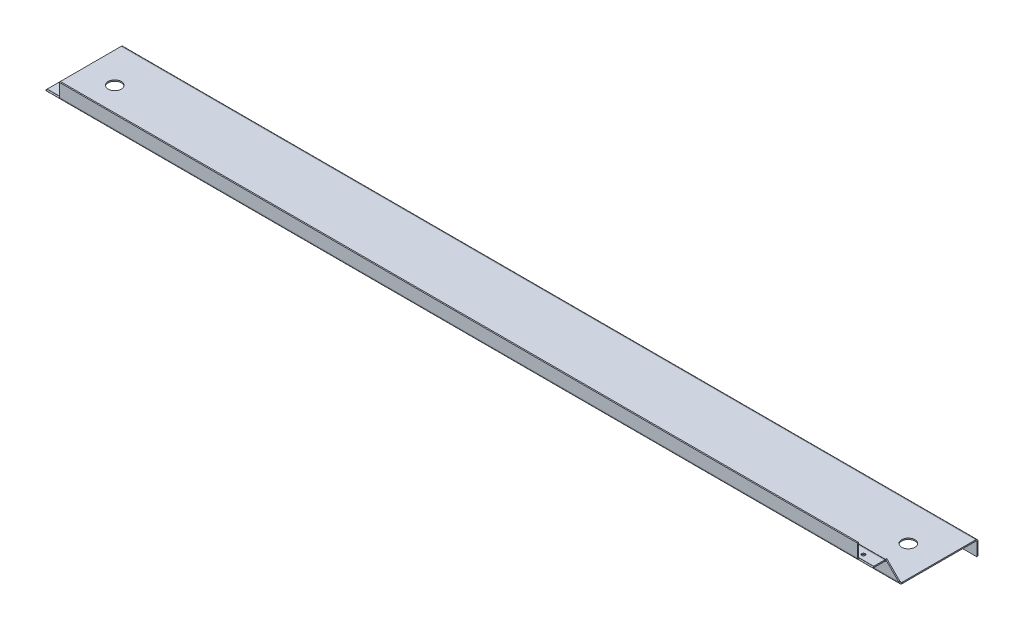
ISO-10303-21;
HEADER;
FILE_DESCRIPTION(('STEP AP214'),'2;1');
FILE_NAME('part.step','',(''),(''),'','','');
FILE_SCHEMA(('AUTOMOTIVE_DESIGN { 1 0 10303 214 1 1 1 1 }'));
ENDSEC;
DATA;
#1=APPLICATION_CONTEXT('core data for automotive mechanical design processes');
#2=APPLICATION_PROTOCOL_DEFINITION('international standard','automotive_design',2000,#1);
#3=PRODUCT_CONTEXT('',#1,'mechanical');
#4=PRODUCT('Part','Part','',(#3));
#5=PRODUCT_RELATED_PRODUCT_CATEGORY('part','',(#4));
#6=PRODUCT_DEFINITION_FORMATION('','',#4);
#7=PRODUCT_DEFINITION_CONTEXT('part definition',#1,'design');
#8=PRODUCT_DEFINITION('design','',#6,#7);
#9=PRODUCT_DEFINITION_SHAPE('','',#8);
#10=(LENGTH_UNIT() NAMED_UNIT(*) SI_UNIT(.MILLI.,.METRE.));
#11=(NAMED_UNIT(*) PLANE_ANGLE_UNIT() SI_UNIT($,.RADIAN.));
#12=(NAMED_UNIT(*) SI_UNIT($,.STERADIAN.) SOLID_ANGLE_UNIT());
#13=UNCERTAINTY_MEASURE_WITH_UNIT(LENGTH_MEASURE(1.E-05),#10,'distance_accuracy_value','');
#14=(GEOMETRIC_REPRESENTATION_CONTEXT(3) GLOBAL_UNCERTAINTY_ASSIGNED_CONTEXT((#13)) GLOBAL_UNIT_ASSIGNED_CONTEXT((#10,
#11,#12)) REPRESENTATION_CONTEXT('',''));
#15=CARTESIAN_POINT('',(0.,0.,0.));
#16=DIRECTION('',(0.,0.,1.));
#17=DIRECTION('',(1.,0.,0.));
#18=AXIS2_PLACEMENT_3D('',#15,#16,#17);
#19=CARTESIAN_POINT('',(-405.9,-968.599999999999,88.6));
#20=DIRECTION('',(-1.,0.,0.));
#21=DIRECTION('',(0.,0.,1.));
#22=AXIS2_PLACEMENT_3D('',#19,#20,#21);
#23=PLANE('',#22);
#24=CARTESIAN_POINT('',(-405.9,-968.599999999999,88.6));
#25=DIRECTION('',(1.,0.,0.));
#26=DIRECTION('',(0.,0.,-1.));
#27=AXIS2_PLACEMENT_3D('',#24,#25,#26);
#28=CIRCLE('',#27,2.2);
#29=CARTESIAN_POINT('',(-405.9,-970.799999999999,88.6));
#30=VERTEX_POINT('',#29);
#31=CARTESIAN_POINT('',(-405.9,-970.559591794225,89.6));
#32=VERTEX_POINT('',#31);
#33=EDGE_CURVE('E339',#30,#32,#28,.F.);
#34=ORIENTED_EDGE('',*,*,#33,.T.);
#35=DIRECTION('',(0.,-0.890723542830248,0.454545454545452));
#36=VECTOR('',#35,1.);
#37=CARTESIAN_POINT('',(-405.9,-970.559591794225,89.6));
#38=LINE('',#37,#36);
#39=CARTESIAN_POINT('',(-405.9,-969.490723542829,89.0545454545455));
#40=VERTEX_POINT('',#39);
#41=EDGE_CURVE('E1445',#40,#32,#38,.T.);
#42=ORIENTED_EDGE('',*,*,#41,.F.);
#43=CARTESIAN_POINT('',(-405.9,-968.599999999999,88.6));
#44=DIRECTION('',(1.,0.,0.));
#45=DIRECTION('',(0.,0.,-1.));
#46=AXIS2_PLACEMENT_3D('',#43,#44,#45);
#47=CIRCLE('',#46,1.);
#48=CARTESIAN_POINT('',(-405.9,-969.599999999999,88.6));
#49=VERTEX_POINT('',#48);
#50=EDGE_CURVE('E345',#49,#40,#47,.F.);
#51=ORIENTED_EDGE('',*,*,#50,.F.);
#52=DIRECTION('',(0.,-1.,0.));
#53=VECTOR('',#52,1.);
#54=CARTESIAN_POINT('',(-405.9,-969.599999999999,88.6));
#55=LINE('',#54,#53);
#56=EDGE_CURVE('E349',#49,#30,#55,.T.);
#57=ORIENTED_EDGE('',*,*,#56,.T.);
#58=EDGE_LOOP('',(#34,#42,#51,#57));
#59=FACE_BOUND('',#58,.T.);
#60=ADVANCED_FACE('F121',(#59),#23,.T.);
#61=CARTESIAN_POINT('',(406.9,-968.599999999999,88.6));
#62=DIRECTION('',(-1.,0.,0.));
#63=DIRECTION('',(0.,0.,1.));
#64=AXIS2_PLACEMENT_3D('',#61,#62,#63);
#65=PLANE('',#64);
#66=CARTESIAN_POINT('',(406.9,-968.599999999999,88.6));
#67=DIRECTION('',(1.,0.,0.));
#68=DIRECTION('',(0.,0.,-1.));
#69=AXIS2_PLACEMENT_3D('',#66,#67,#68);
#70=CIRCLE('',#69,1.);
#71=CARTESIAN_POINT('',(406.9,-969.490723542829,89.0545454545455));
#72=VERTEX_POINT('',#71);
#73=CARTESIAN_POINT('',(406.9,-969.599999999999,88.6));
#74=VERTEX_POINT('',#73);
#75=EDGE_CURVE('E321',#72,#74,#70,.T.);
#76=ORIENTED_EDGE('',*,*,#75,.F.);
#77=DIRECTION('',(0.,-0.89072354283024,0.454545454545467));
#78=VECTOR('',#77,1.);
#79=CARTESIAN_POINT('',(406.9,-970.559591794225,89.6000000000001));
#80=LINE('',#79,#78);
#81=CARTESIAN_POINT('',(406.9,-970.559591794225,89.6000000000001));
#82=VERTEX_POINT('',#81);
#83=EDGE_CURVE('E1424',#82,#72,#80,.F.);
#84=ORIENTED_EDGE('',*,*,#83,.F.);
#85=CARTESIAN_POINT('',(406.9,-968.599999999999,88.6));
#86=DIRECTION('',(1.,0.,0.));
#87=DIRECTION('',(0.,0.,-1.));
#88=AXIS2_PLACEMENT_3D('',#85,#86,#87);
#89=CIRCLE('',#88,2.2);
#90=CARTESIAN_POINT('',(406.9,-970.799999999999,88.6));
#91=VERTEX_POINT('',#90);
#92=EDGE_CURVE('E340',#82,#91,#89,.T.);
#93=ORIENTED_EDGE('',*,*,#92,.T.);
#94=DIRECTION('',(0.,-1.,0.));
#95=VECTOR('',#94,1.);
#96=CARTESIAN_POINT('',(406.9,-969.599999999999,88.6));
#97=LINE('',#96,#95);
#98=EDGE_CURVE('E343',#74,#91,#97,.T.);
#99=ORIENTED_EDGE('',*,*,#98,.F.);
#100=EDGE_LOOP('',(#76,#84,#93,#99));
#101=FACE_BOUND('',#100,.T.);
#102=ADVANCED_FACE('F558',(#101),#65,.F.);
#103=CARTESIAN_POINT('',(406.9,-968.599999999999,88.6));
#104=DIRECTION('',(1.,0.,0.));
#105=DIRECTION('',(0.,0.,1.));
#106=AXIS2_PLACEMENT_3D('',#103,#104,#105);
#107=CYLINDRICAL_SURFACE('',#106,2.2);
#108=CARTESIAN_POINT('',(-391.9,-968.599999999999,88.6));
#109=DIRECTION('',(1.,0.,0.));
#110=DIRECTION('',(0.,0.,-1.));
#111=AXIS2_PLACEMENT_3D('',#108,#109,#110);
#112=CIRCLE('',#111,2.2);
#113=CARTESIAN_POINT('',(-391.9,-968.599999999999,90.8));
#114=VERTEX_POINT('',#113);
#115=CARTESIAN_POINT('',(-391.9,-970.559591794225,89.6));
#116=VERTEX_POINT('',#115);
#117=EDGE_CURVE('E1449',#114,#116,#112,.T.);
#118=ORIENTED_EDGE('',*,*,#117,.T.);
#119=DIRECTION('',(-1.,0.,0.));
#120=VECTOR('',#119,1.);
#121=CARTESIAN_POINT('',(-391.9,-970.559591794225,89.6));
#122=LINE('',#121,#120);
#123=EDGE_CURVE('E1442',#116,#32,#122,.T.);
#124=ORIENTED_EDGE('',*,*,#123,.T.);
#125=ORIENTED_EDGE('',*,*,#33,.F.);
#126=DIRECTION('',(1.,0.,0.));
#127=VECTOR('',#126,1.);
#128=CARTESIAN_POINT('',(406.9,-970.799999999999,88.6));
#129=LINE('',#128,#127);
#130=EDGE_CURVE('E336',#91,#30,#129,.F.);
#131=ORIENTED_EDGE('',*,*,#130,.F.);
#132=ORIENTED_EDGE('',*,*,#92,.F.);
#133=DIRECTION('',(1.,0.,0.));
#134=VECTOR('',#133,1.);
#135=CARTESIAN_POINT('',(406.9,-970.559591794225,89.6000000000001));
#136=LINE('',#135,#134);
#137=CARTESIAN_POINT('',(392.9,-970.559591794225,89.6000000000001));
#138=VERTEX_POINT('',#137);
#139=EDGE_CURVE('E1429',#138,#82,#136,.T.);
#140=ORIENTED_EDGE('',*,*,#139,.F.);
#141=CARTESIAN_POINT('',(392.9,-968.599999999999,88.6));
#142=DIRECTION('',(-1.,0.,0.));
#143=DIRECTION('',(0.,0.,1.));
#144=AXIS2_PLACEMENT_3D('',#141,#142,#143);
#145=CIRCLE('',#144,2.2);
#146=CARTESIAN_POINT('',(392.9,-968.599999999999,90.800000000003));
#147=VERTEX_POINT('',#146);
#148=EDGE_CURVE('E309',#147,#138,#145,.F.);
#149=ORIENTED_EDGE('',*,*,#148,.F.);
#150=DIRECTION('',(1.,0.,0.));
#151=VECTOR('',#150,1.);
#152=CARTESIAN_POINT('',(0.,-968.599999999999,90.8));
#153=LINE('',#152,#151);
#154=EDGE_CURVE('E317',#114,#147,#153,.T.);
#155=ORIENTED_EDGE('',*,*,#154,.F.);
#156=EDGE_LOOP('',(#118,#124,#125,#131,#132,#140,#149,#155));
#157=FACE_BOUND('',#156,.T.);
#158=ADVANCED_FACE('F564',(#157),#107,.T.);
#159=CARTESIAN_POINT('',(406.9,-968.599999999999,88.6));
#160=DIRECTION('',(1.,0.,0.));
#161=DIRECTION('',(0.,0.,1.));
#162=AXIS2_PLACEMENT_3D('',#159,#160,#161);
#163=CYLINDRICAL_SURFACE('',#162,1.);
#164=DIRECTION('',(-1.,0.,0.));
#165=VECTOR('',#164,1.);
#166=CARTESIAN_POINT('',(813.303595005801,-969.490723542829,89.0545454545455));
#167=LINE('',#166,#165);
#168=CARTESIAN_POINT('',(-391.9,-969.490723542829,89.0545454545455));
#169=VERTEX_POINT('',#168);
#170=EDGE_CURVE('E1447',#169,#40,#167,.T.);
#171=ORIENTED_EDGE('',*,*,#170,.F.);
#172=CARTESIAN_POINT('',(-391.9,-968.599999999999,88.6));
#173=DIRECTION('',(-1.,0.,0.));
#174=DIRECTION('',(0.,0.,1.));
#175=AXIS2_PLACEMENT_3D('',#172,#173,#174);
#176=CIRCLE('',#175,1.);
#177=CARTESIAN_POINT('',(-391.9,-968.599999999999,89.6));
#178=VERTEX_POINT('',#177);
#179=EDGE_CURVE('E1455',#178,#169,#176,.F.);
#180=ORIENTED_EDGE('',*,*,#179,.F.);
#181=DIRECTION('',(-1.,0.,0.));
#182=VECTOR('',#181,1.);
#183=CARTESIAN_POINT('',(-405.9,-968.599999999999,89.6));
#184=LINE('',#183,#182);
#185=CARTESIAN_POINT('',(392.9,-968.599999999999,89.6));
#186=VERTEX_POINT('',#185);
#187=EDGE_CURVE('E332',#178,#186,#184,.F.);
#188=ORIENTED_EDGE('',*,*,#187,.T.);
#189=CARTESIAN_POINT('',(392.9,-968.599999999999,88.6));
#190=DIRECTION('',(1.,0.,0.));
#191=DIRECTION('',(0.,0.,-1.));
#192=AXIS2_PLACEMENT_3D('',#189,#190,#191);
#193=CIRCLE('',#192,1.);
#194=CARTESIAN_POINT('',(392.9,-969.490723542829,89.0545454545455));
#195=VERTEX_POINT('',#194);
#196=EDGE_CURVE('E1431',#186,#195,#193,.T.);
#197=ORIENTED_EDGE('',*,*,#196,.T.);
#198=DIRECTION('',(1.,0.,0.));
#199=VECTOR('',#198,1.);
#200=CARTESIAN_POINT('',(406.9,-969.490723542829,89.0545454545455));
#201=LINE('',#200,#199);
#202=EDGE_CURVE('E1434',#195,#72,#201,.T.);
#203=ORIENTED_EDGE('',*,*,#202,.T.);
#204=ORIENTED_EDGE('',*,*,#75,.T.);
#205=DIRECTION('',(1.,0.,0.));
#206=VECTOR('',#205,1.);
#207=CARTESIAN_POINT('',(406.9,-969.599999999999,88.6));
#208=LINE('',#207,#206);
#209=EDGE_CURVE('E324',#74,#49,#208,.F.);
#210=ORIENTED_EDGE('',*,*,#209,.T.);
#211=ORIENTED_EDGE('',*,*,#50,.T.);
#212=EDGE_LOOP('',(#171,#180,#188,#197,#203,#204,#210,#211));
#213=FACE_BOUND('',#212,.T.);
#214=ADVANCED_FACE('F568',(#213),#163,.F.);
#215=CARTESIAN_POINT('',(0.,-2.78125241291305E-13,90.800000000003));
#216=DIRECTION('',(0.,0.,1.));
#217=DIRECTION('',(0.,-1.,0.));
#218=AXIS2_PLACEMENT_3D('',#215,#216,#217);
#219=PLANE('',#218);
#220=DIRECTION('',(1.,0.,0.));
#221=VECTOR('',#220,1.);
#222=CARTESIAN_POINT('',(406.9,-955.799999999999,90.8000000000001));
#223=LINE('',#222,#221);
#224=CARTESIAN_POINT('',(-391.9,-955.799999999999,90.8000000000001));
#225=VERTEX_POINT('',#224);
#226=CARTESIAN_POINT('',(392.9,-955.799999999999,90.8000000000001));
#227=VERTEX_POINT('',#226);
#228=EDGE_CURVE('E315',#225,#227,#223,.T.);
#229=ORIENTED_EDGE('',*,*,#228,.F.);
#230=DIRECTION('',(0.,-1.,0.));
#231=VECTOR('',#230,1.);
#232=CARTESIAN_POINT('',(-391.9,-4.44089209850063E-13,90.800000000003));
#233=LINE('',#232,#231);
#234=EDGE_CURVE('E138',#114,#225,#233,.F.);
#235=ORIENTED_EDGE('',*,*,#234,.F.);
#236=ORIENTED_EDGE('',*,*,#154,.T.);
#237=DIRECTION('',(0.,-1.,0.));
#238=VECTOR('',#237,1.);
#239=CARTESIAN_POINT('',(392.9,-962.199999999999,90.8000000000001));
#240=LINE('',#239,#238);
#241=EDGE_CURVE('E303',#227,#147,#240,.T.);
#242=ORIENTED_EDGE('',*,*,#241,.F.);
#243=EDGE_LOOP('',(#229,#235,#236,#242));
#244=FACE_BOUND('',#243,.T.);
#245=ADVANCED_FACE('F314',(#244),#219,.T.);
#246=CARTESIAN_POINT('',(0.,-2.73935463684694E-13,89.600000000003));
#247=DIRECTION('',(0.,0.,1.));
#248=DIRECTION('',(0.,-1.,0.));
#249=AXIS2_PLACEMENT_3D('',#246,#247,#248);
#250=PLANE('',#249);
#251=DIRECTION('',(0.,1.,0.));
#252=VECTOR('',#251,1.);
#253=CARTESIAN_POINT('',(-391.9,-955.799999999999,89.6));
#254=LINE('',#253,#252);
#255=CARTESIAN_POINT('',(-391.9,-955.799999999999,89.6000000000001));
#256=VERTEX_POINT('',#255);
#257=EDGE_CURVE('E1438',#178,#256,#254,.T.);
#258=ORIENTED_EDGE('',*,*,#257,.T.);
#259=DIRECTION('',(-1.,0.,0.));
#260=VECTOR('',#259,1.);
#261=CARTESIAN_POINT('',(0.,-955.799999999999,89.6000000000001));
#262=LINE('',#261,#260);
#263=CARTESIAN_POINT('',(392.9,-955.799999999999,89.6000000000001));
#264=VERTEX_POINT('',#263);
#265=EDGE_CURVE('E322',#256,#264,#262,.F.);
#266=ORIENTED_EDGE('',*,*,#265,.T.);
#267=DIRECTION('',(0.,-1.,0.));
#268=VECTOR('',#267,1.);
#269=CARTESIAN_POINT('',(392.9,-955.799999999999,89.6000000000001));
#270=LINE('',#269,#268);
#271=EDGE_CURVE('E146',#264,#186,#270,.T.);
#272=ORIENTED_EDGE('',*,*,#271,.T.);
#273=ORIENTED_EDGE('',*,*,#187,.F.);
#274=EDGE_LOOP('',(#258,#266,#272,#273));
#275=FACE_BOUND('',#274,.T.);
#276=ADVANCED_FACE('F844',(#275),#250,.F.);
#277=CARTESIAN_POINT('',(406.9,-955.799999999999,90.8000000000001));
#278=DIRECTION('',(0.,1.,0.));
#279=DIRECTION('',(0.,0.,1.));
#280=AXIS2_PLACEMENT_3D('',#277,#278,#279);
#281=PLANE('',#280);
#282=ORIENTED_EDGE('',*,*,#265,.F.);
#283=DIRECTION('',(0.,0.,-1.));
#284=VECTOR('',#283,1.);
#285=CARTESIAN_POINT('',(-391.9,-955.799999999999,89.6));
#286=LINE('',#285,#284);
#287=EDGE_CURVE('E320',#256,#225,#286,.F.);
#288=ORIENTED_EDGE('',*,*,#287,.T.);
#289=ORIENTED_EDGE('',*,*,#228,.T.);
#290=DIRECTION('',(0.,0.,1.));
#291=VECTOR('',#290,1.);
#292=CARTESIAN_POINT('',(392.9,-955.799999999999,89.6000000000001));
#293=LINE('',#292,#291);
#294=EDGE_CURVE('E300',#227,#264,#293,.F.);
#295=ORIENTED_EDGE('',*,*,#294,.T.);
#296=EDGE_LOOP('',(#282,#288,#289,#295));
#297=FACE_BOUND('',#296,.T.);
#298=ADVANCED_FACE('F319',(#297),#281,.T.);
#299=CARTESIAN_POINT('',(-405.9,-969.599999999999,90.8));
#300=DIRECTION('',(1.,0.,0.));
#301=DIRECTION('',(0.,0.,-1.));
#302=AXIS2_PLACEMENT_3D('',#299,#300,#301);
#303=PLANE('',#302);
#304=ORIENTED_EDGE('',*,*,#56,.F.);
#305=DIRECTION('',(0.,0.,1.));
#306=VECTOR('',#305,1.);
#307=CARTESIAN_POINT('',(-405.9,-969.599999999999,0.));
#308=LINE('',#307,#306);
#309=CARTESIAN_POINT('',(-405.9,-969.599999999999,78.0000000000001));
#310=VERTEX_POINT('',#309);
#311=EDGE_CURVE('E358',#310,#49,#308,.T.);
#312=ORIENTED_EDGE('',*,*,#311,.F.);
#313=DIRECTION('',(0.,-1.,0.));
#314=VECTOR('',#313,1.);
#315=CARTESIAN_POINT('',(-405.9,-970.799999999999,78.0000000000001));
#316=LINE('',#315,#314);
#317=CARTESIAN_POINT('',(-405.9,-970.799999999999,78.0000000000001));
#318=VERTEX_POINT('',#317);
#319=EDGE_CURVE('E369',#318,#310,#316,.F.);
#320=ORIENTED_EDGE('',*,*,#319,.F.);
#321=DIRECTION('',(0.,0.,-1.));
#322=VECTOR('',#321,1.);
#323=CARTESIAN_POINT('',(-405.9,-970.799999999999,90.8));
#324=LINE('',#323,#322);
#325=EDGE_CURVE('E363',#318,#30,#324,.F.);
#326=ORIENTED_EDGE('',*,*,#325,.T.);
#327=EDGE_LOOP('',(#304,#312,#320,#326));
#328=FACE_BOUND('',#327,.T.);
#329=ADVANCED_FACE('F583',(#328),#303,.F.);
#330=CARTESIAN_POINT('',(406.9,-969.599999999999,77.));
#331=DIRECTION('',(-1.,0.,0.));
#332=DIRECTION('',(0.,0.,1.));
#333=AXIS2_PLACEMENT_3D('',#330,#331,#332);
#334=PLANE('',#333);
#335=ORIENTED_EDGE('',*,*,#98,.T.);
#336=DIRECTION('',(0.,0.,1.));
#337=VECTOR('',#336,1.);
#338=CARTESIAN_POINT('',(406.9,-970.799999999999,77.));
#339=LINE('',#338,#337);
#340=CARTESIAN_POINT('',(406.9,-970.799999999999,78.0000000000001));
#341=VERTEX_POINT('',#340);
#342=EDGE_CURVE('E361',#91,#341,#339,.F.);
#343=ORIENTED_EDGE('',*,*,#342,.T.);
#344=DIRECTION('',(0.,-1.,0.));
#345=VECTOR('',#344,1.);
#346=CARTESIAN_POINT('',(406.9,-969.599999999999,78.0000000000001));
#347=LINE('',#346,#345);
#348=CARTESIAN_POINT('',(406.9,-969.599999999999,78.0000000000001));
#349=VERTEX_POINT('',#348);
#350=EDGE_CURVE('E352',#341,#349,#347,.F.);
#351=ORIENTED_EDGE('',*,*,#350,.T.);
#352=DIRECTION('',(0.,0.,-1.));
#353=VECTOR('',#352,1.);
#354=CARTESIAN_POINT('',(406.9,-969.599999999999,0.));
#355=LINE('',#354,#353);
#356=EDGE_CURVE('E355',#74,#349,#355,.T.);
#357=ORIENTED_EDGE('',*,*,#356,.F.);
#358=EDGE_LOOP('',(#335,#343,#351,#357));
#359=FACE_BOUND('',#358,.T.);
#360=ADVANCED_FACE('F575',(#359),#334,.F.);
#361=CARTESIAN_POINT('',(0.,-969.599999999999,0.));
#362=DIRECTION('',(0.,-1.,0.));
#363=DIRECTION('',(0.,0.,-1.));
#364=AXIS2_PLACEMENT_3D('',#361,#362,#363);
#365=PLANE('',#364);
#366=CARTESIAN_POINT('',(391.9,-969.599999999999,83.8000000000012));
#367=DIRECTION('',(0.,1.,0.));
#368=DIRECTION('',(0.,0.,1.));
#369=AXIS2_PLACEMENT_3D('',#366,#367,#368);
#370=CIRCLE('',#369,1.64999999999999);
#371=CARTESIAN_POINT('',(391.9,-969.599999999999,85.4500000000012));
#372=VERTEX_POINT('',#371);
#373=EDGE_CURVE('E1466',#372,#372,#370,.T.);
#374=ORIENTED_EDGE('',*,*,#373,.F.);
#375=EDGE_LOOP('',(#374));
#376=FACE_BOUND('',#375,.T.);
#377=CARTESIAN_POINT('',(0.499999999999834,-969.599999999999,83.8000000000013));
#378=DIRECTION('',(0.,1.,0.));
#379=DIRECTION('',(0.,0.,1.));
#380=AXIS2_PLACEMENT_3D('',#377,#378,#379);
#381=CIRCLE('',#380,1.64999999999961);
#382=CARTESIAN_POINT('',(0.499999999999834,-969.599999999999,85.4500000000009));
#383=VERTEX_POINT('',#382);
#384=EDGE_CURVE('E1483',#383,#383,#381,.T.);
#385=ORIENTED_EDGE('',*,*,#384,.F.);
#386=EDGE_LOOP('',(#385));
#387=FACE_BOUND('',#386,.T.);
#388=CARTESIAN_POINT('',(-390.9,-969.599999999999,83.800000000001));
#389=DIRECTION('',(0.,1.,0.));
#390=DIRECTION('',(0.,0.,1.));
#391=AXIS2_PLACEMENT_3D('',#388,#389,#390);
#392=CIRCLE('',#391,1.64999999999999);
#393=CARTESIAN_POINT('',(-390.9,-969.599999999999,85.450000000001));
#394=VERTEX_POINT('',#393);
#395=EDGE_CURVE('E1477',#394,#394,#392,.T.);
#396=ORIENTED_EDGE('',*,*,#395,.F.);
#397=EDGE_LOOP('',(#396));
#398=FACE_BOUND('',#397,.T.);
#399=ORIENTED_EDGE('',*,*,#209,.F.);
#400=ORIENTED_EDGE('',*,*,#356,.T.);
#401=DIRECTION('',(-1.,0.,0.));
#402=VECTOR('',#401,1.);
#403=CARTESIAN_POINT('',(406.9,-969.599999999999,78.0000000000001));
#404=LINE('',#403,#402);
#405=EDGE_CURVE('E366',#310,#349,#404,.F.);
#406=ORIENTED_EDGE('',*,*,#405,.F.);
#407=ORIENTED_EDGE('',*,*,#311,.T.);
#408=EDGE_LOOP('',(#399,#400,#406,#407));
#409=FACE_BOUND('',#408,.T.);
#410=ADVANCED_FACE('F571',(#376,#387,#398,#409),#365,.F.);
#411=CARTESIAN_POINT('',(0.,-970.799999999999,0.));
#412=DIRECTION('',(0.,-1.,0.));
#413=DIRECTION('',(0.,0.,-1.));
#414=AXIS2_PLACEMENT_3D('',#411,#412,#413);
#415=PLANE('',#414);
#416=CARTESIAN_POINT('',(391.9,-970.799999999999,83.8000000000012));
#417=DIRECTION('',(0.,-1.,0.));
#418=DIRECTION('',(0.,0.,-1.));
#419=AXIS2_PLACEMENT_3D('',#416,#417,#418);
#420=CIRCLE('',#419,1.64999999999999);
#421=CARTESIAN_POINT('',(391.9,-970.799999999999,82.1500000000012));
#422=VERTEX_POINT('',#421);
#423=EDGE_CURVE('E1486',#422,#422,#420,.F.);
#424=ORIENTED_EDGE('',*,*,#423,.T.);
#425=EDGE_LOOP('',(#424));
#426=FACE_BOUND('',#425,.T.);
#427=CARTESIAN_POINT('',(0.499999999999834,-970.799999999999,83.8000000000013));
#428=DIRECTION('',(0.,-1.,0.));
#429=DIRECTION('',(0.,0.,-1.));
#430=AXIS2_PLACEMENT_3D('',#427,#428,#429);
#431=CIRCLE('',#430,1.64999999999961);
#432=CARTESIAN_POINT('',(0.499999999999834,-970.799999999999,82.1500000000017));
#433=VERTEX_POINT('',#432);
#434=EDGE_CURVE('E1480',#433,#433,#431,.F.);
#435=ORIENTED_EDGE('',*,*,#434,.T.);
#436=EDGE_LOOP('',(#435));
#437=FACE_BOUND('',#436,.T.);
#438=CARTESIAN_POINT('',(-390.9,-970.799999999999,83.800000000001));
#439=DIRECTION('',(0.,-1.,0.));
#440=DIRECTION('',(0.,0.,-1.));
#441=AXIS2_PLACEMENT_3D('',#438,#439,#440);
#442=CIRCLE('',#441,1.64999999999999);
#443=CARTESIAN_POINT('',(-390.9,-970.799999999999,82.150000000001));
#444=VERTEX_POINT('',#443);
#445=EDGE_CURVE('E1474',#444,#444,#442,.F.);
#446=ORIENTED_EDGE('',*,*,#445,.T.);
#447=EDGE_LOOP('',(#446));
#448=FACE_BOUND('',#447,.T.);
#449=ORIENTED_EDGE('',*,*,#342,.F.);
#450=ORIENTED_EDGE('',*,*,#130,.T.);
#451=ORIENTED_EDGE('',*,*,#325,.F.);
#452=DIRECTION('',(-1.,0.,0.));
#453=VECTOR('',#452,1.);
#454=CARTESIAN_POINT('',(406.9,-970.799999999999,78.0000000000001));
#455=LINE('',#454,#453);
#456=EDGE_CURVE('E372',#341,#318,#455,.T.);
#457=ORIENTED_EDGE('',*,*,#456,.F.);
#458=EDGE_LOOP('',(#449,#450,#451,#457));
#459=FACE_BOUND('',#458,.T.);
#460=ADVANCED_FACE('F574',(#426,#437,#448,#459),#415,.T.);
#461=CARTESIAN_POINT('',(-405.9,-969.599999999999,77.));
#462=DIRECTION('',(1.,0.,0.));
#463=DIRECTION('',(0.,0.,-1.));
#464=AXIS2_PLACEMENT_3D('',#461,#462,#463);
#465=PLANE('',#464);
#466=DIRECTION('',(0.,-1.,0.));
#467=VECTOR('',#466,1.);
#468=CARTESIAN_POINT('',(-405.9,-969.599999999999,77.));
#469=LINE('',#468,#467);
#470=CARTESIAN_POINT('',(-405.9,-969.599999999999,77.));
#471=VERTEX_POINT('',#470);
#472=CARTESIAN_POINT('',(-405.9,-969.840408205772,77.));
#473=VERTEX_POINT('',#472);
#474=EDGE_CURVE('E392',#471,#473,#469,.T.);
#475=ORIENTED_EDGE('',*,*,#474,.T.);
#476=CARTESIAN_POINT('',(-405.9,-971.799999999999,78.0000000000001));
#477=DIRECTION('',(-1.,0.,0.));
#478=DIRECTION('',(0.,0.,1.));
#479=AXIS2_PLACEMENT_3D('',#476,#477,#478);
#480=CIRCLE('',#479,2.2);
#481=CARTESIAN_POINT('',(-405.9,-971.799999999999,75.8));
#482=VERTEX_POINT('',#481);
#483=EDGE_CURVE('E13',#473,#482,#480,.T.);
#484=ORIENTED_EDGE('',*,*,#483,.T.);
#485=DIRECTION('',(0.,1.,0.));
#486=VECTOR('',#485,1.);
#487=CARTESIAN_POINT('',(-405.9,0.,75.800000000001));
#488=LINE('',#487,#486);
#489=CARTESIAN_POINT('',(-405.9,-969.599999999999,75.8));
#490=VERTEX_POINT('',#489);
#491=EDGE_CURVE('E402',#482,#490,#488,.T.);
#492=ORIENTED_EDGE('',*,*,#491,.T.);
#493=DIRECTION('',(0.,0.,-1.));
#494=VECTOR('',#493,1.);
#495=CARTESIAN_POINT('',(-405.9,-969.599999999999,77.));
#496=LINE('',#495,#494);
#497=EDGE_CURVE('E410',#471,#490,#496,.T.);
#498=ORIENTED_EDGE('',*,*,#497,.F.);
#499=EDGE_LOOP('',(#475,#484,#492,#498));
#500=FACE_BOUND('',#499,.T.);
#501=ADVANCED_FACE('F579',(#500),#465,.T.);
#502=CARTESIAN_POINT('',(406.9,-971.799999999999,77.0000000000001));
#503=DIRECTION('',(-1.,0.,0.));
#504=DIRECTION('',(0.,0.,1.));
#505=AXIS2_PLACEMENT_3D('',#502,#503,#504);
#506=PLANE('',#505);
#507=DIRECTION('',(0.,-1.,0.));
#508=VECTOR('',#507,1.);
#509=CARTESIAN_POINT('',(406.9,0.,75.800000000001));
#510=LINE('',#509,#508);
#511=CARTESIAN_POINT('',(406.9,-969.599999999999,75.8));
#512=VERTEX_POINT('',#511);
#513=CARTESIAN_POINT('',(406.9,-971.799999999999,75.8));
#514=VERTEX_POINT('',#513);
#515=EDGE_CURVE('E395',#512,#514,#510,.T.);
#516=ORIENTED_EDGE('',*,*,#515,.T.);
#517=CARTESIAN_POINT('',(406.9,-971.799999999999,78.0000000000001));
#518=DIRECTION('',(-1.,0.,0.));
#519=DIRECTION('',(0.,0.,1.));
#520=AXIS2_PLACEMENT_3D('',#517,#518,#519);
#521=CIRCLE('',#520,2.2);
#522=CARTESIAN_POINT('',(406.9,-969.840408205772,77.));
#523=VERTEX_POINT('',#522);
#524=EDGE_CURVE('E379',#514,#523,#521,.F.);
#525=ORIENTED_EDGE('',*,*,#524,.T.);
#526=DIRECTION('',(0.,1.,0.));
#527=VECTOR('',#526,1.);
#528=CARTESIAN_POINT('',(406.9,-971.799999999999,77.0000000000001));
#529=LINE('',#528,#527);
#530=CARTESIAN_POINT('',(406.9,-969.599999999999,77.));
#531=VERTEX_POINT('',#530);
#532=EDGE_CURVE('E381',#523,#531,#529,.T.);
#533=ORIENTED_EDGE('',*,*,#532,.T.);
#534=DIRECTION('',(0.,0.,-1.));
#535=VECTOR('',#534,1.);
#536=CARTESIAN_POINT('',(406.9,-969.599999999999,77.));
#537=LINE('',#536,#535);
#538=EDGE_CURVE('E406',#531,#512,#537,.T.);
#539=ORIENTED_EDGE('',*,*,#538,.T.);
#540=EDGE_LOOP('',(#516,#525,#533,#539));
#541=FACE_BOUND('',#540,.T.);
#542=ADVANCED_FACE('F605',(#541),#506,.T.);
#543=CARTESIAN_POINT('',(0.,0.,77.000000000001));
#544=DIRECTION('',(0.,0.,1.));
#545=DIRECTION('',(0.,-1.,0.));
#546=AXIS2_PLACEMENT_3D('',#543,#544,#545);
#547=PLANE('',#546);
#548=DIRECTION('',(-1.,0.,0.));
#549=VECTOR('',#548,1.);
#550=CARTESIAN_POINT('',(-405.9,-971.799999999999,77.0000000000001));
#551=LINE('',#550,#549);
#552=CARTESIAN_POINT('',(-405.9,-971.799999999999,77.));
#553=VERTEX_POINT('',#552);
#554=CARTESIAN_POINT('',(406.9,-971.799999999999,77.));
#555=VERTEX_POINT('',#554);
#556=EDGE_CURVE('E387',#553,#555,#551,.F.);
#557=ORIENTED_EDGE('',*,*,#556,.F.);
#558=EDGE_CURVE('E396',#473,#553,#469,.T.);
#559=ORIENTED_EDGE('',*,*,#558,.F.);
#560=ORIENTED_EDGE('',*,*,#474,.F.);
#561=DIRECTION('',(0.70710678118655,0.707106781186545,0.));
#562=VECTOR('',#561,1.);
#563=CARTESIAN_POINT('',(-405.9,-969.599999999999,77.));
#564=LINE('',#563,#562);
#565=CARTESIAN_POINT('',(-418.7,-982.399999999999,77.));
#566=VERTEX_POINT('',#565);
#567=EDGE_CURVE('E416',#566,#471,#564,.T.);
#568=ORIENTED_EDGE('',*,*,#567,.F.);
#569=DIRECTION('',(1.,0.,0.));
#570=VECTOR('',#569,1.);
#571=CARTESIAN_POINT('',(1.30091018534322E-13,-982.399999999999,77.));
#572=LINE('',#571,#570);
#573=CARTESIAN_POINT('',(419.7,-982.399999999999,77.));
#574=VERTEX_POINT('',#573);
#575=EDGE_CURVE('E424',#566,#574,#572,.T.);
#576=ORIENTED_EDGE('',*,*,#575,.T.);
#577=DIRECTION('',(0.70710678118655,-0.707106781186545,0.));
#578=VECTOR('',#577,1.);
#579=CARTESIAN_POINT('',(420.7,-983.399999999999,77.));
#580=LINE('',#579,#578);
#581=EDGE_CURVE('E413',#531,#574,#580,.T.);
#582=ORIENTED_EDGE('',*,*,#581,.F.);
#583=ORIENTED_EDGE('',*,*,#532,.F.);
#584=EDGE_CURVE('E397',#555,#523,#529,.T.);
#585=ORIENTED_EDGE('',*,*,#584,.F.);
#586=EDGE_LOOP('',(#557,#559,#560,#568,#576,#582,#583,#585));
#587=FACE_BOUND('',#586,.T.);
#588=ADVANCED_FACE('F608',(#587),#547,.T.);
#589=CARTESIAN_POINT('',(0.,0.,75.800000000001));
#590=DIRECTION('',(0.,0.,1.));
#591=DIRECTION('',(0.,-1.,0.));
#592=AXIS2_PLACEMENT_3D('',#589,#590,#591);
#593=PLANE('',#592);
#594=ORIENTED_EDGE('',*,*,#491,.F.);
#595=DIRECTION('',(-1.,0.,0.));
#596=VECTOR('',#595,1.);
#597=CARTESIAN_POINT('',(-405.9,-971.799999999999,75.8000000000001));
#598=LINE('',#597,#596);
#599=EDGE_CURVE('E376',#482,#514,#598,.F.);
#600=ORIENTED_EDGE('',*,*,#599,.T.);
#601=ORIENTED_EDGE('',*,*,#515,.F.);
#602=DIRECTION('',(-0.70710678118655,0.707106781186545,0.));
#603=VECTOR('',#602,1.);
#604=CARTESIAN_POINT('',(-281.350000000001,-281.350000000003,75.8000000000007));
#605=LINE('',#604,#603);
#606=CARTESIAN_POINT('',(419.7,-982.399999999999,75.8));
#607=VERTEX_POINT('',#606);
#608=EDGE_CURVE('E419',#512,#607,#605,.F.);
#609=ORIENTED_EDGE('',*,*,#608,.T.);
#610=DIRECTION('',(-1.,0.,0.));
#611=VECTOR('',#610,1.);
#612=CARTESIAN_POINT('',(-418.7,-982.399999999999,75.8));
#613=LINE('',#612,#611);
#614=CARTESIAN_POINT('',(-418.7,-982.399999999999,75.8));
#615=VERTEX_POINT('',#614);
#616=EDGE_CURVE('E430',#615,#607,#613,.F.);
#617=ORIENTED_EDGE('',*,*,#616,.F.);
#618=DIRECTION('',(-0.70710678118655,-0.707106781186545,0.));
#619=VECTOR('',#618,1.);
#620=CARTESIAN_POINT('',(281.850000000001,-281.850000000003,75.8000000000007));
#621=LINE('',#620,#619);
#622=EDGE_CURVE('E422',#615,#490,#621,.F.);
#623=ORIENTED_EDGE('',*,*,#622,.T.);
#624=EDGE_LOOP('',(#594,#600,#601,#609,#617,#623));
#625=FACE_BOUND('',#624,.T.);
#626=ADVANCED_FACE('F523',(#625),#593,.F.);
#627=CARTESIAN_POINT('',(-419.7,-983.399999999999,77.));
#628=DIRECTION('',(1.,0.,0.));
#629=DIRECTION('',(0.,0.,-1.));
#630=AXIS2_PLACEMENT_3D('',#627,#628,#629);
#631=PLANE('',#630);
#632=DIRECTION('',(0.,-1.,0.));
#633=VECTOR('',#632,1.);
#634=CARTESIAN_POINT('',(-419.7,-983.399999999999,74.8));
#635=LINE('',#634,#633);
#636=CARTESIAN_POINT('',(-419.7,-983.399999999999,74.8));
#637=VERTEX_POINT('',#636);
#638=CARTESIAN_POINT('',(-419.7,-984.599999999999,74.8));
#639=VERTEX_POINT('',#638);
#640=EDGE_CURVE('E442',#637,#639,#635,.T.);
#641=ORIENTED_EDGE('',*,*,#640,.F.);
#642=DIRECTION('',(0.,0.,1.));
#643=VECTOR('',#642,1.);
#644=CARTESIAN_POINT('',(-419.7,-983.399999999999,2.87653138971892E-12));
#645=LINE('',#644,#643);
#646=CARTESIAN_POINT('',(-419.7,-983.399999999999,2.19999999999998));
#647=VERTEX_POINT('',#646);
#648=EDGE_CURVE('E651',#647,#637,#645,.T.);
#649=ORIENTED_EDGE('',*,*,#648,.F.);
#650=DIRECTION('',(0.,-1.,0.));
#651=VECTOR('',#650,1.);
#652=CARTESIAN_POINT('',(-419.7,-984.599999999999,2.19999999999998));
#653=LINE('',#652,#651);
#654=CARTESIAN_POINT('',(-419.7,-984.599999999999,2.19999999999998));
#655=VERTEX_POINT('',#654);
#656=EDGE_CURVE('E660',#655,#647,#653,.F.);
#657=ORIENTED_EDGE('',*,*,#656,.F.);
#658=DIRECTION('',(0.,0.,-1.));
#659=VECTOR('',#658,1.);
#660=CARTESIAN_POINT('',(-419.7,-984.599999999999,77.));
#661=LINE('',#660,#659);
#662=EDGE_CURVE('E652',#655,#639,#661,.F.);
#663=ORIENTED_EDGE('',*,*,#662,.T.);
#664=EDGE_LOOP('',(#641,#649,#657,#663));
#665=FACE_BOUND('',#664,.T.);
#666=ADVANCED_FACE('F519',(#665),#631,.F.);
#667=CARTESIAN_POINT('',(420.7,-983.399999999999,1.2));
#668=DIRECTION('',(-1.,0.,0.));
#669=DIRECTION('',(0.,0.,1.));
#670=AXIS2_PLACEMENT_3D('',#667,#668,#669);
#671=PLANE('',#670);
#672=DIRECTION('',(0.,-1.,0.));
#673=VECTOR('',#672,1.);
#674=CARTESIAN_POINT('',(420.7,-983.399999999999,74.8));
#675=LINE('',#674,#673);
#676=CARTESIAN_POINT('',(420.7,-983.399999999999,74.8));
#677=VERTEX_POINT('',#676);
#678=CARTESIAN_POINT('',(420.7,-984.599999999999,74.8));
#679=VERTEX_POINT('',#678);
#680=EDGE_CURVE('E446',#677,#679,#675,.T.);
#681=ORIENTED_EDGE('',*,*,#680,.T.);
#682=DIRECTION('',(0.,0.,1.));
#683=VECTOR('',#682,1.);
#684=CARTESIAN_POINT('',(420.7,-984.599999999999,1.2));
#685=LINE('',#684,#683);
#686=CARTESIAN_POINT('',(420.7,-984.599999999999,2.19999999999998));
#687=VERTEX_POINT('',#686);
#688=EDGE_CURVE('E644',#679,#687,#685,.F.);
#689=ORIENTED_EDGE('',*,*,#688,.T.);
#690=DIRECTION('',(0.,-1.,0.));
#691=VECTOR('',#690,1.);
#692=CARTESIAN_POINT('',(420.7,-983.399999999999,2.19999999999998));
#693=LINE('',#692,#691);
#694=CARTESIAN_POINT('',(420.7,-983.399999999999,2.19999999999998));
#695=VERTEX_POINT('',#694);
#696=EDGE_CURVE('E445',#687,#695,#693,.F.);
#697=ORIENTED_EDGE('',*,*,#696,.T.);
#698=DIRECTION('',(0.,0.,-1.));
#699=VECTOR('',#698,1.);
#700=CARTESIAN_POINT('',(420.7,-983.399999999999,2.87653138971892E-12));
#701=LINE('',#700,#699);
#702=EDGE_CURVE('E494',#677,#695,#701,.T.);
#703=ORIENTED_EDGE('',*,*,#702,.F.);
#704=EDGE_LOOP('',(#681,#689,#697,#703));
#705=FACE_BOUND('',#704,.T.);
#706=ADVANCED_FACE('F512',(#705),#671,.F.);
#707=CARTESIAN_POINT('',(0.,-983.399999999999,2.87653138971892E-12));
#708=DIRECTION('',(0.,-1.,0.));
#709=DIRECTION('',(0.,0.,-1.));
#710=AXIS2_PLACEMENT_3D('',#707,#708,#709);
#711=PLANE('',#710);
#712=CARTESIAN_POINT('',(390.7,-983.399999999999,38.5000000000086));
#713=DIRECTION('',(0.,1.,0.));
#714=DIRECTION('',(0.,0.,1.));
#715=AXIS2_PLACEMENT_3D('',#712,#713,#714);
#716=CIRCLE('',#715,6.49999999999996);
#717=CARTESIAN_POINT('',(390.7,-983.399999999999,45.0000000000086));
#718=VERTEX_POINT('',#717);
#719=EDGE_CURVE('E1459',#718,#718,#716,.T.);
#720=ORIENTED_EDGE('',*,*,#719,.F.);
#721=EDGE_LOOP('',(#720));
#722=FACE_BOUND('',#721,.T.);
#723=CARTESIAN_POINT('',(-389.7,-983.399999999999,38.5000000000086));
#724=DIRECTION('',(0.,1.,0.));
#725=DIRECTION('',(0.,0.,1.));
#726=AXIS2_PLACEMENT_3D('',#723,#724,#725);
#727=CIRCLE('',#726,6.49999999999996);
#728=CARTESIAN_POINT('',(-389.7,-983.399999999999,45.0000000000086));
#729=VERTEX_POINT('',#728);
#730=EDGE_CURVE('E1465',#729,#729,#727,.T.);
#731=ORIENTED_EDGE('',*,*,#730,.F.);
#732=EDGE_LOOP('',(#731));
#733=FACE_BOUND('',#732,.T.);
#734=DIRECTION('',(1.,0.,0.));
#735=VECTOR('',#734,1.);
#736=CARTESIAN_POINT('',(420.7,-983.399999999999,74.8));
#737=LINE('',#736,#735);
#738=EDGE_CURVE('E434',#677,#637,#737,.F.);
#739=ORIENTED_EDGE('',*,*,#738,.F.);
#740=ORIENTED_EDGE('',*,*,#702,.T.);
#741=DIRECTION('',(-1.,0.,0.));
#742=VECTOR('',#741,1.);
#743=CARTESIAN_POINT('',(420.7,-983.399999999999,2.19999999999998));
#744=LINE('',#743,#742);
#745=EDGE_CURVE('E655',#647,#695,#744,.F.);
#746=ORIENTED_EDGE('',*,*,#745,.F.);
#747=ORIENTED_EDGE('',*,*,#648,.T.);
#748=EDGE_LOOP('',(#739,#740,#746,#747));
#749=FACE_BOUND('',#748,.T.);
#750=ADVANCED_FACE('F502',(#722,#733,#749),#711,.F.);
#751=CARTESIAN_POINT('',(0.,-984.599999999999,2.88072116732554E-12));
#752=DIRECTION('',(0.,-1.,0.));
#753=DIRECTION('',(0.,0.,-1.));
#754=AXIS2_PLACEMENT_3D('',#751,#752,#753);
#755=PLANE('',#754);
#756=CARTESIAN_POINT('',(390.7,-984.599999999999,38.5000000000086));
#757=DIRECTION('',(0.,-1.,0.));
#758=DIRECTION('',(0.,0.,-1.));
#759=AXIS2_PLACEMENT_3D('',#756,#757,#758);
#760=CIRCLE('',#759,6.49999999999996);
#761=CARTESIAN_POINT('',(390.7,-984.599999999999,32.0000000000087));
#762=VERTEX_POINT('',#761);
#763=EDGE_CURVE('E1469',#762,#762,#760,.F.);
#764=ORIENTED_EDGE('',*,*,#763,.T.);
#765=EDGE_LOOP('',(#764));
#766=FACE_BOUND('',#765,.T.);
#767=CARTESIAN_POINT('',(-389.7,-984.599999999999,38.5000000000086));
#768=DIRECTION('',(0.,-1.,0.));
#769=DIRECTION('',(0.,0.,-1.));
#770=AXIS2_PLACEMENT_3D('',#767,#768,#769);
#771=CIRCLE('',#770,6.49999999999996);
#772=CARTESIAN_POINT('',(-389.7,-984.599999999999,32.0000000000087));
#773=VERTEX_POINT('',#772);
#774=EDGE_CURVE('E1462',#773,#773,#771,.F.);
#775=ORIENTED_EDGE('',*,*,#774,.T.);
#776=EDGE_LOOP('',(#775));
#777=FACE_BOUND('',#776,.T.);
#778=ORIENTED_EDGE('',*,*,#688,.F.);
#779=DIRECTION('',(1.,0.,0.));
#780=VECTOR('',#779,1.);
#781=CARTESIAN_POINT('',(420.7,-984.599999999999,74.8));
#782=LINE('',#781,#780);
#783=EDGE_CURVE('E437',#679,#639,#782,.F.);
#784=ORIENTED_EDGE('',*,*,#783,.T.);
#785=ORIENTED_EDGE('',*,*,#662,.F.);
#786=DIRECTION('',(-1.,0.,0.));
#787=VECTOR('',#786,1.);
#788=CARTESIAN_POINT('',(420.7,-984.599999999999,2.19999999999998));
#789=LINE('',#788,#787);
#790=EDGE_CURVE('E650',#687,#655,#789,.T.);
#791=ORIENTED_EDGE('',*,*,#790,.F.);
#792=EDGE_LOOP('',(#778,#784,#785,#791));
#793=FACE_BOUND('',#792,.T.);
#794=ADVANCED_FACE('F511',(#766,#777,#793),#755,.T.);
#795=CARTESIAN_POINT('',(-419.7,-983.399999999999,1.2));
#796=DIRECTION('',(1.,0.,0.));
#797=DIRECTION('',(0.,0.,-1.));
#798=AXIS2_PLACEMENT_3D('',#795,#796,#797);
#799=PLANE('',#798);
#800=DIRECTION('',(0.,0.,-1.));
#801=VECTOR('',#800,1.);
#802=CARTESIAN_POINT('',(-419.7,-985.599999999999,1.19999999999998));
#803=LINE('',#802,#801);
#804=CARTESIAN_POINT('',(-419.7,-985.599999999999,1.2));
#805=VERTEX_POINT('',#804);
#806=CARTESIAN_POINT('',(-419.7,-985.599999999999,0.));
#807=VERTEX_POINT('',#806);
#808=EDGE_CURVE('E671',#805,#807,#803,.T.);
#809=ORIENTED_EDGE('',*,*,#808,.T.);
#810=DIRECTION('',(0.,-1.,0.));
#811=VECTOR('',#810,1.);
#812=CARTESIAN_POINT('',(-419.7,-983.399999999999,0.));
#813=LINE('',#812,#811);
#814=CARTESIAN_POINT('',(-419.7,-998.399999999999,0.));
#815=VERTEX_POINT('',#814);
#816=EDGE_CURVE('E686',#807,#815,#813,.T.);
#817=ORIENTED_EDGE('',*,*,#816,.T.);
#818=DIRECTION('',(0.,0.,-1.));
#819=VECTOR('',#818,1.);
#820=CARTESIAN_POINT('',(-419.7,-998.399999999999,1.2));
#821=LINE('',#820,#819);
#822=CARTESIAN_POINT('',(-419.7,-998.399999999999,1.2));
#823=VERTEX_POINT('',#822);
#824=EDGE_CURVE('E125',#823,#815,#821,.T.);
#825=ORIENTED_EDGE('',*,*,#824,.F.);
#826=DIRECTION('',(0.,-1.,0.));
#827=VECTOR('',#826,1.);
#828=CARTESIAN_POINT('',(-419.7,-983.399999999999,1.2));
#829=LINE('',#828,#827);
#830=EDGE_CURVE('E688',#805,#823,#829,.T.);
#831=ORIENTED_EDGE('',*,*,#830,.F.);
#832=EDGE_LOOP('',(#809,#817,#825,#831));
#833=FACE_BOUND('',#832,.T.);
#834=ADVANCED_FACE('F123',(#833),#799,.F.);
#835=CARTESIAN_POINT('',(420.7,-983.399999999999,1.2));
#836=DIRECTION('',(-1.,0.,0.));
#837=DIRECTION('',(0.,0.,1.));
#838=AXIS2_PLACEMENT_3D('',#835,#836,#837);
#839=PLANE('',#838);
#840=DIRECTION('',(0.,0.,-1.));
#841=VECTOR('',#840,1.);
#842=CARTESIAN_POINT('',(420.7,-985.599999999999,1.19999999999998));
#843=LINE('',#842,#841);
#844=CARTESIAN_POINT('',(420.7,-985.599999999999,1.2));
#845=VERTEX_POINT('',#844);
#846=CARTESIAN_POINT('',(420.7,-985.599999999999,0.));
#847=VERTEX_POINT('',#846);
#848=EDGE_CURVE('E683',#845,#847,#843,.T.);
#849=ORIENTED_EDGE('',*,*,#848,.F.);
#850=DIRECTION('',(0.,1.,0.));
#851=VECTOR('',#850,1.);
#852=CARTESIAN_POINT('',(420.7,-983.399999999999,1.2));
#853=LINE('',#852,#851);
#854=CARTESIAN_POINT('',(420.7,-998.399999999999,1.2));
#855=VERTEX_POINT('',#854);
#856=EDGE_CURVE('E693',#855,#845,#853,.T.);
#857=ORIENTED_EDGE('',*,*,#856,.F.);
#858=DIRECTION('',(0.,0.,-1.));
#859=VECTOR('',#858,1.);
#860=CARTESIAN_POINT('',(420.7,-998.399999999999,1.2));
#861=LINE('',#860,#859);
#862=CARTESIAN_POINT('',(420.7,-998.399999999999,0.));
#863=VERTEX_POINT('',#862);
#864=EDGE_CURVE('E696',#855,#863,#861,.T.);
#865=ORIENTED_EDGE('',*,*,#864,.T.);
#866=DIRECTION('',(0.,1.,0.));
#867=VECTOR('',#866,1.);
#868=CARTESIAN_POINT('',(420.7,-983.399999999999,0.));
#869=LINE('',#868,#867);
#870=EDGE_CURVE('E691',#863,#847,#869,.T.);
#871=ORIENTED_EDGE('',*,*,#870,.T.);
#872=EDGE_LOOP('',(#849,#857,#865,#871));
#873=FACE_BOUND('',#872,.T.);
#874=ADVANCED_FACE('F546',(#873),#839,.F.);
#875=CARTESIAN_POINT('',(0.,0.,1.2));
#876=DIRECTION('',(0.,0.,1.));
#877=DIRECTION('',(1.,0.,0.));
#878=AXIS2_PLACEMENT_3D('',#875,#876,#877);
#879=PLANE('',#878);
#880=CARTESIAN_POINT('',(390.7,-991.999999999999,1.20000000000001));
#881=DIRECTION('',(0.,0.,1.));
#882=DIRECTION('',(1.,0.,0.));
#883=AXIS2_PLACEMENT_3D('',#880,#881,#882);
#884=CIRCLE('',#883,3.99999999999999);
#885=CARTESIAN_POINT('',(394.7,-991.999999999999,1.20000000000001));
#886=VERTEX_POINT('',#885);
#887=EDGE_CURVE('E1377',#886,#886,#884,.F.);
#888=ORIENTED_EDGE('',*,*,#887,.T.);
#889=EDGE_LOOP('',(#888));
#890=FACE_BOUND('',#889,.T.);
#891=CARTESIAN_POINT('',(195.6,-991.999999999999,1.20000000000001));
#892=DIRECTION('',(0.,0.,1.));
#893=DIRECTION('',(1.,0.,0.));
#894=AXIS2_PLACEMENT_3D('',#891,#892,#893);
#895=CIRCLE('',#894,3.99999999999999);
#896=CARTESIAN_POINT('',(199.6,-991.999999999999,1.20000000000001));
#897=VERTEX_POINT('',#896);
#898=EDGE_CURVE('E1390',#897,#897,#895,.F.);
#899=ORIENTED_EDGE('',*,*,#898,.T.);
#900=EDGE_LOOP('',(#899));
#901=FACE_BOUND('',#900,.T.);
#902=CARTESIAN_POINT('',(0.499999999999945,-992.,1.20000000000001));
#903=DIRECTION('',(0.,0.,1.));
#904=DIRECTION('',(1.,0.,0.));
#905=AXIS2_PLACEMENT_3D('',#902,#903,#904);
#906=CIRCLE('',#905,4.00000000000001);
#907=CARTESIAN_POINT('',(4.49999999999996,-992.,1.20000000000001));
#908=VERTEX_POINT('',#907);
#909=EDGE_CURVE('E1396',#908,#908,#906,.F.);
#910=ORIENTED_EDGE('',*,*,#909,.T.);
#911=EDGE_LOOP('',(#910));
#912=FACE_BOUND('',#911,.T.);
#913=CARTESIAN_POINT('',(-194.6,-991.999999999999,1.20000000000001));
#914=DIRECTION('',(0.,0.,1.));
#915=DIRECTION('',(1.,0.,0.));
#916=AXIS2_PLACEMENT_3D('',#913,#914,#915);
#917=CIRCLE('',#916,3.99999999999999);
#918=CARTESIAN_POINT('',(-190.6,-991.999999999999,1.20000000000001));
#919=VERTEX_POINT('',#918);
#920=EDGE_CURVE('E1402',#919,#919,#917,.F.);
#921=ORIENTED_EDGE('',*,*,#920,.T.);
#922=EDGE_LOOP('',(#921));
#923=FACE_BOUND('',#922,.T.);
#924=CARTESIAN_POINT('',(-389.7,-991.999999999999,1.20000000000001));
#925=DIRECTION('',(0.,0.,1.));
#926=DIRECTION('',(1.,0.,0.));
#927=AXIS2_PLACEMENT_3D('',#924,#925,#926);
#928=CIRCLE('',#927,3.99999999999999);
#929=CARTESIAN_POINT('',(-385.7,-991.999999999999,1.20000000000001));
#930=VERTEX_POINT('',#929);
#931=EDGE_CURVE('E1408',#930,#930,#928,.F.);
#932=ORIENTED_EDGE('',*,*,#931,.T.);
#933=EDGE_LOOP('',(#932));
#934=FACE_BOUND('',#933,.T.);
#935=CARTESIAN_POINT('',(-409.7,-991.999999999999,1.2));
#936=DIRECTION('',(0.,0.,1.));
#937=DIRECTION('',(1.,0.,0.));
#938=AXIS2_PLACEMENT_3D('',#935,#936,#937);
#939=CIRCLE('',#938,1.50000000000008);
#940=CARTESIAN_POINT('',(-408.2,-991.999999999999,1.2));
#941=VERTEX_POINT('',#940);
#942=EDGE_CURVE('E1375',#941,#941,#939,.T.);
#943=ORIENTED_EDGE('',*,*,#942,.F.);
#944=EDGE_LOOP('',(#943));
#945=FACE_BOUND('',#944,.T.);
#946=CARTESIAN_POINT('',(410.7,-991.999999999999,1.2));
#947=DIRECTION('',(0.,0.,1.));
#948=DIRECTION('',(1.,0.,0.));
#949=AXIS2_PLACEMENT_3D('',#946,#947,#948);
#950=CIRCLE('',#949,1.50000000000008);
#951=CARTESIAN_POINT('',(412.2,-991.999999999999,1.2));
#952=VERTEX_POINT('',#951);
#953=EDGE_CURVE('E328',#952,#952,#950,.T.);
#954=ORIENTED_EDGE('',*,*,#953,.F.);
#955=EDGE_LOOP('',(#954));
#956=FACE_BOUND('',#955,.T.);
#957=ORIENTED_EDGE('',*,*,#856,.T.);
#958=DIRECTION('',(-1.,0.,0.));
#959=VECTOR('',#958,1.);
#960=CARTESIAN_POINT('',(-419.7,-985.599999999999,1.19999999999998));
#961=LINE('',#960,#959);
#962=EDGE_CURVE('E677',#805,#845,#961,.F.);
#963=ORIENTED_EDGE('',*,*,#962,.F.);
#964=ORIENTED_EDGE('',*,*,#830,.T.);
#965=DIRECTION('',(1.,0.,0.));
#966=VECTOR('',#965,1.);
#967=CARTESIAN_POINT('',(-419.7,-998.399999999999,1.2));
#968=LINE('',#967,#966);
#969=EDGE_CURVE('E690',#823,#855,#968,.T.);
#970=ORIENTED_EDGE('',*,*,#969,.T.);
#971=EDGE_LOOP('',(#957,#963,#964,#970));
#972=FACE_BOUND('',#971,.T.);
#973=ADVANCED_FACE('F542',(#890,#901,#912,#923,#934,#945,#956,#972),#879,.T.);
#974=CARTESIAN_POINT('',(0.,0.,0.));
#975=DIRECTION('',(0.,0.,1.));
#976=DIRECTION('',(1.,0.,0.));
#977=AXIS2_PLACEMENT_3D('',#974,#975,#976);
#978=PLANE('',#977);
#979=CARTESIAN_POINT('',(390.7,-991.999999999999,0.));
#980=DIRECTION('',(0.,0.,-1.));
#981=DIRECTION('',(-1.,0.,0.));
#982=AXIS2_PLACEMENT_3D('',#979,#980,#981);
#983=CIRCLE('',#982,3.99999999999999);
#984=CARTESIAN_POINT('',(386.7,-991.999999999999,0.));
#985=VERTEX_POINT('',#984);
#986=EDGE_CURVE('E1374',#985,#985,#983,.T.);
#987=ORIENTED_EDGE('',*,*,#986,.F.);
#988=EDGE_LOOP('',(#987));
#989=FACE_BOUND('',#988,.T.);
#990=CARTESIAN_POINT('',(195.6,-991.999999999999,0.));
#991=DIRECTION('',(0.,0.,-1.));
#992=DIRECTION('',(-1.,0.,0.));
#993=AXIS2_PLACEMENT_3D('',#990,#991,#992);
#994=CIRCLE('',#993,3.99999999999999);
#995=CARTESIAN_POINT('',(191.6,-991.999999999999,0.));
#996=VERTEX_POINT('',#995);
#997=EDGE_CURVE('E1382',#996,#996,#994,.T.);
#998=ORIENTED_EDGE('',*,*,#997,.F.);
#999=EDGE_LOOP('',(#998));
#1000=FACE_BOUND('',#999,.T.);
#1001=CARTESIAN_POINT('',(0.499999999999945,-992.,0.));
#1002=DIRECTION('',(0.,0.,-1.));
#1003=DIRECTION('',(-1.,0.,0.));
#1004=AXIS2_PLACEMENT_3D('',#1001,#1002,#1003);
#1005=CIRCLE('',#1004,4.00000000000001);
#1006=CARTESIAN_POINT('',(-3.50000000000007,-992.,0.));
#1007=VERTEX_POINT('',#1006);
#1008=EDGE_CURVE('E1393',#1007,#1007,#1005,.T.);
#1009=ORIENTED_EDGE('',*,*,#1008,.F.);
#1010=EDGE_LOOP('',(#1009));
#1011=FACE_BOUND('',#1010,.T.);
#1012=CARTESIAN_POINT('',(-194.6,-991.999999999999,0.));
#1013=DIRECTION('',(0.,0.,-1.));
#1014=DIRECTION('',(-1.,0.,0.));
#1015=AXIS2_PLACEMENT_3D('',#1012,#1013,#1014);
#1016=CIRCLE('',#1015,3.99999999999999);
#1017=CARTESIAN_POINT('',(-198.6,-991.999999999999,0.));
#1018=VERTEX_POINT('',#1017);
#1019=EDGE_CURVE('E1399',#1018,#1018,#1016,.T.);
#1020=ORIENTED_EDGE('',*,*,#1019,.F.);
#1021=EDGE_LOOP('',(#1020));
#1022=FACE_BOUND('',#1021,.T.);
#1023=CARTESIAN_POINT('',(-389.7,-991.999999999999,0.));
#1024=DIRECTION('',(0.,0.,-1.));
#1025=DIRECTION('',(-1.,0.,0.));
#1026=AXIS2_PLACEMENT_3D('',#1023,#1024,#1025);
#1027=CIRCLE('',#1026,3.99999999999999);
#1028=CARTESIAN_POINT('',(-393.7,-991.999999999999,0.));
#1029=VERTEX_POINT('',#1028);
#1030=EDGE_CURVE('E1405',#1029,#1029,#1027,.T.);
#1031=ORIENTED_EDGE('',*,*,#1030,.F.);
#1032=EDGE_LOOP('',(#1031));
#1033=FACE_BOUND('',#1032,.T.);
#1034=CARTESIAN_POINT('',(-409.7,-991.999999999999,0.));
#1035=DIRECTION('',(0.,0.,1.));
#1036=DIRECTION('',(1.,0.,0.));
#1037=AXIS2_PLACEMENT_3D('',#1034,#1035,#1036);
#1038=CIRCLE('',#1037,1.50000000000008);
#1039=CARTESIAN_POINT('',(-408.2,-991.999999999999,0.));
#1040=VERTEX_POINT('',#1039);
#1041=EDGE_CURVE('E335',#1040,#1040,#1038,.T.);
#1042=ORIENTED_EDGE('',*,*,#1041,.T.);
#1043=EDGE_LOOP('',(#1042));
#1044=FACE_BOUND('',#1043,.T.);
#1045=CARTESIAN_POINT('',(410.7,-991.999999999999,0.));
#1046=DIRECTION('',(0.,0.,1.));
#1047=DIRECTION('',(1.,0.,0.));
#1048=AXIS2_PLACEMENT_3D('',#1045,#1046,#1047);
#1049=CIRCLE('',#1048,1.50000000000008);
#1050=CARTESIAN_POINT('',(412.2,-991.999999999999,0.));
#1051=VERTEX_POINT('',#1050);
#1052=EDGE_CURVE('E1370',#1051,#1051,#1049,.T.);
#1053=ORIENTED_EDGE('',*,*,#1052,.T.);
#1054=EDGE_LOOP('',(#1053));
#1055=FACE_BOUND('',#1054,.T.);
#1056=DIRECTION('',(-1.,0.,0.));
#1057=VECTOR('',#1056,1.);
#1058=CARTESIAN_POINT('',(-419.7,-985.599999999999,0.));
#1059=LINE('',#1058,#1057);
#1060=EDGE_CURVE('E665',#807,#847,#1059,.F.);
#1061=ORIENTED_EDGE('',*,*,#1060,.T.);
#1062=ORIENTED_EDGE('',*,*,#870,.F.);
#1063=DIRECTION('',(1.,0.,0.));
#1064=VECTOR('',#1063,1.);
#1065=CARTESIAN_POINT('',(-419.7,-998.399999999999,0.));
#1066=LINE('',#1065,#1064);
#1067=EDGE_CURVE('E698',#815,#863,#1066,.T.);
#1068=ORIENTED_EDGE('',*,*,#1067,.F.);
#1069=ORIENTED_EDGE('',*,*,#816,.F.);
#1070=EDGE_LOOP('',(#1061,#1062,#1068,#1069));
#1071=FACE_BOUND('',#1070,.T.);
#1072=ADVANCED_FACE('F545',(#989,#1000,#1011,#1022,#1033,#1044,#1055,#1071),#978,.F.);
#1073=CARTESIAN_POINT('',(-419.7,-998.399999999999,1.2));
#1074=DIRECTION('',(0.,1.,0.));
#1075=DIRECTION('',(0.,0.,1.));
#1076=AXIS2_PLACEMENT_3D('',#1073,#1074,#1075);
#1077=PLANE('',#1076);
#1078=ORIENTED_EDGE('',*,*,#1067,.T.);
#1079=ORIENTED_EDGE('',*,*,#864,.F.);
#1080=ORIENTED_EDGE('',*,*,#969,.F.);
#1081=ORIENTED_EDGE('',*,*,#824,.T.);
#1082=EDGE_LOOP('',(#1078,#1079,#1080,#1081));
#1083=FACE_BOUND('',#1082,.T.);
#1084=ADVANCED_FACE('F537',(#1083),#1077,.F.);
#1085=CARTESIAN_POINT('',(420.7,-985.599999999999,2.19999999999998));
#1086=DIRECTION('',(1.,0.,0.));
#1087=DIRECTION('',(0.,0.,-1.));
#1088=AXIS2_PLACEMENT_3D('',#1085,#1086,#1087);
#1089=PLANE('',#1088);
#1090=ORIENTED_EDGE('',*,*,#696,.F.);
#1091=CARTESIAN_POINT('',(420.7,-985.599999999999,2.19999999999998));
#1092=DIRECTION('',(-1.,0.,0.));
#1093=DIRECTION('',(0.,0.,1.));
#1094=AXIS2_PLACEMENT_3D('',#1091,#1092,#1093);
#1095=CIRCLE('',#1094,1.);
#1096=EDGE_CURVE('E674',#845,#687,#1095,.F.);
#1097=ORIENTED_EDGE('',*,*,#1096,.F.);
#1098=ORIENTED_EDGE('',*,*,#848,.T.);
#1099=CARTESIAN_POINT('',(420.7,-985.599999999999,2.19999999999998));
#1100=DIRECTION('',(-1.,0.,0.));
#1101=DIRECTION('',(0.,0.,1.));
#1102=AXIS2_PLACEMENT_3D('',#1099,#1100,#1101);
#1103=CIRCLE('',#1102,2.2);
#1104=EDGE_CURVE('E667',#847,#695,#1103,.F.);
#1105=ORIENTED_EDGE('',*,*,#1104,.T.);
#1106=EDGE_LOOP('',(#1090,#1097,#1098,#1105));
#1107=FACE_BOUND('',#1106,.T.);
#1108=ADVANCED_FACE('F534',(#1107),#1089,.T.);
#1109=CARTESIAN_POINT('',(-419.7,-985.599999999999,2.19999999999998));
#1110=DIRECTION('',(1.,0.,0.));
#1111=DIRECTION('',(0.,0.,-1.));
#1112=AXIS2_PLACEMENT_3D('',#1109,#1110,#1111);
#1113=PLANE('',#1112);
#1114=CARTESIAN_POINT('',(-419.7,-985.599999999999,2.19999999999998));
#1115=DIRECTION('',(-1.,0.,0.));
#1116=DIRECTION('',(0.,0.,1.));
#1117=AXIS2_PLACEMENT_3D('',#1114,#1115,#1116);
#1118=CIRCLE('',#1117,1.);
#1119=EDGE_CURVE('E680',#655,#805,#1118,.T.);
#1120=ORIENTED_EDGE('',*,*,#1119,.F.);
#1121=ORIENTED_EDGE('',*,*,#656,.T.);
#1122=CARTESIAN_POINT('',(-419.7,-985.599999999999,2.19999999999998));
#1123=DIRECTION('',(-1.,0.,0.));
#1124=DIRECTION('',(0.,0.,1.));
#1125=AXIS2_PLACEMENT_3D('',#1122,#1123,#1124);
#1126=CIRCLE('',#1125,2.2);
#1127=EDGE_CURVE('E668',#647,#807,#1126,.T.);
#1128=ORIENTED_EDGE('',*,*,#1127,.T.);
#1129=ORIENTED_EDGE('',*,*,#808,.F.);
#1130=EDGE_LOOP('',(#1120,#1121,#1128,#1129));
#1131=FACE_BOUND('',#1130,.T.);
#1132=ADVANCED_FACE('F529',(#1131),#1113,.F.);
#1133=CARTESIAN_POINT('',(-419.7,-985.599999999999,2.19999999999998));
#1134=DIRECTION('',(-1.,0.,0.));
#1135=DIRECTION('',(0.,1.,0.));
#1136=AXIS2_PLACEMENT_3D('',#1133,#1134,#1135);
#1137=CYLINDRICAL_SURFACE('',#1136,2.2);
#1138=ORIENTED_EDGE('',*,*,#1060,.F.);
#1139=ORIENTED_EDGE('',*,*,#1127,.F.);
#1140=ORIENTED_EDGE('',*,*,#745,.T.);
#1141=ORIENTED_EDGE('',*,*,#1104,.F.);
#1142=EDGE_LOOP('',(#1138,#1139,#1140,#1141));
#1143=FACE_BOUND('',#1142,.T.);
#1144=ADVANCED_FACE('F525',(#1143),#1137,.T.);
#1145=CARTESIAN_POINT('',(-419.7,-985.599999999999,2.19999999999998));
#1146=DIRECTION('',(-1.,0.,0.));
#1147=DIRECTION('',(0.,1.,0.));
#1148=AXIS2_PLACEMENT_3D('',#1145,#1146,#1147);
#1149=CYLINDRICAL_SURFACE('',#1148,1.);
#1150=ORIENTED_EDGE('',*,*,#962,.T.);
#1151=ORIENTED_EDGE('',*,*,#1096,.T.);
#1152=ORIENTED_EDGE('',*,*,#790,.T.);
#1153=ORIENTED_EDGE('',*,*,#1119,.T.);
#1154=EDGE_LOOP('',(#1150,#1151,#1152,#1153));
#1155=FACE_BOUND('',#1154,.T.);
#1156=ADVANCED_FACE('F528',(#1155),#1149,.F.);
#1157=CARTESIAN_POINT('',(-419.7,-984.611999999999,74.8));
#1158=CARTESIAN_POINT('',(-419.616652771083,-984.611999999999,75.0895983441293));
#1159=CARTESIAN_POINT('',(-419.533333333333,-984.554427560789,75.3789863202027));
#1160=CARTESIAN_POINT('',(-419.366666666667,-984.332815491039,75.9140051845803));
#1161=CARTESIAN_POINT('',(-419.283333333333,-984.168863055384,76.1593773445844));
#1162=CARTESIAN_POINT('',(-419.116666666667,-983.759377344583,76.5688630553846));
#1163=CARTESIAN_POINT('',(-419.033333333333,-983.51400518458,76.7328154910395));
#1164=CARTESIAN_POINT('',(-418.866666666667,-982.978986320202,76.9544275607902));
#1165=CARTESIAN_POINT('',(-418.783347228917,-982.689598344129,77.0119999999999));
#1166=CARTESIAN_POINT('',(-418.7,-982.399999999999,77.012));
#1167=CARTESIAN_POINT('',(-419.7,-984.599999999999,74.8));
#1168=CARTESIAN_POINT('',(-419.616652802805,-984.599999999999,75.0880272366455));
#1169=CARTESIAN_POINT('',(-419.533333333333,-984.542739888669,75.3758453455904));
#1170=CARTESIAN_POINT('',(-419.366666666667,-984.322330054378,75.9079617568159));
#1171=CARTESIAN_POINT('',(-419.283333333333,-984.159267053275,76.1520027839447));
#1172=CARTESIAN_POINT('',(-419.116666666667,-983.752002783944,76.5592670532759));
#1173=CARTESIAN_POINT('',(-419.033333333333,-983.507961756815,76.7223300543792));
#1174=CARTESIAN_POINT('',(-418.866666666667,-982.97584534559,76.9427398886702));
#1175=CARTESIAN_POINT('',(-418.783347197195,-982.688027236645,76.9999999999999));
#1176=CARTESIAN_POINT('',(-418.7,-982.399999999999,77.));
#1177=CARTESIAN_POINT('',(-419.7,-983.399999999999,74.8));
#1178=CARTESIAN_POINT('',(-419.616655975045,-983.399999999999,74.93091648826));
#1179=CARTESIAN_POINT('',(-419.533333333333,-983.373972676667,75.0617478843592));
#1180=CARTESIAN_POINT('',(-419.366666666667,-983.273786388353,75.3036189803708));
#1181=CARTESIAN_POINT('',(-419.283333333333,-983.199666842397,75.4145467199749));
#1182=CARTESIAN_POINT('',(-419.116666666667,-983.014546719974,75.5996668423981));
#1183=CARTESIAN_POINT('',(-419.033333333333,-982.90361898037,75.6737863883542));
#1184=CARTESIAN_POINT('',(-418.866666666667,-982.661747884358,75.7739726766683));
#1185=CARTESIAN_POINT('',(-418.783344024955,-982.530916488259,75.8));
#1186=CARTESIAN_POINT('',(-418.7,-982.399999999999,75.8));
#1187=CARTESIAN_POINT('',(-419.7,-983.387879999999,74.8));
#1188=CARTESIAN_POINT('',(-419.616656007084,-983.387879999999,74.9293296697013));
#1189=CARTESIAN_POINT('',(-419.533333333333,-983.362168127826,75.0585755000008));
#1190=CARTESIAN_POINT('',(-419.366666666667,-983.263196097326,75.2975151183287));
#1191=CARTESIAN_POINT('',(-419.283333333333,-983.189974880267,75.4070984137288));
#1192=CARTESIAN_POINT('',(-419.116666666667,-983.007098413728,75.5899748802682));
#1193=CARTESIAN_POINT('',(-419.033333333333,-982.897515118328,75.6631960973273));
#1194=CARTESIAN_POINT('',(-418.866666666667,-982.6585755,75.7621681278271));
#1195=CARTESIAN_POINT('',(-418.783343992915,-982.5293296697,75.78788));
#1196=CARTESIAN_POINT('',(-418.7,-982.399999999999,75.78788));
#1197=B_SPLINE_SURFACE_WITH_KNOTS('',1,3,((#1157,#1158,#1159,#1160,#1161,#1162,#1163,#1164,
#1165,#1166),(#1167,#1168,#1169,#1170,#1171,#1172,#1173,#1174,#1175,#1176),(#1177,#1178,#1179,
#1180,#1181,#1182,#1183,#1184,#1185,#1186),(#1187,#1188,#1189,#1190,#1191,#1192,#1193,#1194,
#1195,#1196)),.UNSPECIFIED.,.F.,.F.,.F.,(2,1,1,2),(4,2,2,2,4),(-0.01,0.,1.,1.0101),(0.,0.25,0.5,
0.75,1.),.UNSPECIFIED.);
#1198=DIRECTION('',(0.,0.,1.));
#1199=VECTOR('',#1198,1.);
#1200=CARTESIAN_POINT('',(-418.7,-982.399999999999,77.));
#1201=LINE('',#1200,#1199);
#1202=EDGE_CURVE('E405',#615,#566,#1201,.T.);
#1203=CARTESIAN_POINT('',(-419.7,-983.399999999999,74.8));
#1204=CARTESIAN_POINT('',(-419.677104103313,-983.400007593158,74.835962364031));
#1205=CARTESIAN_POINT('',(-419.654210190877,-983.39806023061,74.8719230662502));
#1206=CARTESIAN_POINT('',(-419.608423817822,-983.390312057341,74.9434269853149));
#1207=CARTESIAN_POINT('',(-419.585531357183,-983.384511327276,74.9789702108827));
#1208=CARTESIAN_POINT('',(-419.539778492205,-983.369124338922,75.0491742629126));
#1209=CARTESIAN_POINT('',(-419.516918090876,-983.359543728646,75.0838363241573));
#1210=CARTESIAN_POINT('',(-419.471204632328,-983.336720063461,75.1519180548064));
#1211=CARTESIAN_POINT('',(-419.448351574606,-983.323477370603,75.1853378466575));
#1212=CARTESIAN_POINT('',(-419.38299968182,-983.280564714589,75.2785905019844));
#1213=CARTESIAN_POINT('',(-419.340473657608,-983.246550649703,75.3364749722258));
#1214=CARTESIAN_POINT('',(-419.255464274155,-983.167722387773,75.4442546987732));
#1215=CARTESIAN_POINT('',(-419.212980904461,-983.122914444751,75.4941545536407));
#1216=CARTESIAN_POINT('',(-419.128015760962,-983.024269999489,75.5840518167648));
#1217=CARTESIAN_POINT('',(-419.085533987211,-982.970434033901,75.624049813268));
#1218=CARTESIAN_POINT('',(-419.000550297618,-982.855859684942,75.6925518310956));
#1219=CARTESIAN_POINT('',(-418.95804837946,-982.795119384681,75.7210526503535));
#1220=CARTESIAN_POINT('',(-418.879615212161,-982.678913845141,75.7619730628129));
#1221=CARTESIAN_POINT('',(-418.843680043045,-982.62407673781,75.7761932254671));
#1222=CARTESIAN_POINT('',(-418.771833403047,-982.512834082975,75.7952253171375));
#1223=CARTESIAN_POINT('',(-418.73592193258,-982.456429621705,75.8000436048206));
#1224=CARTESIAN_POINT('',(-418.7,-982.399999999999,75.8));
#1225=B_SPLINE_CURVE_WITH_KNOTS('',3,(#1203,#1204,#1205,#1206,#1207,#1208,#1209,#1210,#1211,
#1212,#1213,#1214,#1215,#1216,#1217,#1218,#1219,#1220,#1221,#1222,#1223,#1224),.UNSPECIFIED.,
.F.,.F.,(4,2,2,2,2,2,2,2,2,2,4),(0.,0.127848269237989,0.25569386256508,0.383349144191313,
0.510991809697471,0.748186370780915,0.985243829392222,1.22228720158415,1.45939654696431,
1.65999150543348,1.86045075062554),.UNSPECIFIED.);
#1226=EDGE_CURVE('E436',#637,#615,#1225,.T.);
#1227=CARTESIAN_POINT('',(-419.7,-984.599999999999,74.8));
#1228=CARTESIAN_POINT('',(-419.681355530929,-984.600007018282,74.8644277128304));
#1229=CARTESIAN_POINT('',(-419.662712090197,-984.597169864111,74.928852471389));
#1230=CARTESIAN_POINT('',(-419.625426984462,-984.585861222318,75.0572025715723));
#1231=CARTESIAN_POINT('',(-419.606785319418,-984.577390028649,75.1211279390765));
#1232=CARTESIAN_POINT('',(-419.569516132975,-984.554876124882,75.2479429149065));
#1233=CARTESIAN_POINT('',(-419.550888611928,-984.54083778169,75.3108332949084));
#1234=CARTESIAN_POINT('',(-419.513637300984,-984.507312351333,75.4351250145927));
#1235=CARTESIAN_POINT('',(-419.495013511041,-984.487825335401,75.4965263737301));
#1236=CARTESIAN_POINT('',(-419.43912219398,-984.421358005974,75.677868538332));
#1237=CARTESIAN_POINT('',(-419.401825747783,-984.366365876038,75.794978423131));
#1238=CARTESIAN_POINT('',(-419.3272659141,-984.236801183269,76.0176942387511));
#1239=CARTESIAN_POINT('',(-419.290002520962,-984.162233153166,76.1233028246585));
#1240=CARTESIAN_POINT('',(-419.21546723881,-983.995791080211,76.3198773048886));
#1241=CARTESIAN_POINT('',(-419.178195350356,-983.903917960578,76.4108439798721));
#1242=CARTESIAN_POINT('',(-419.103644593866,-983.705652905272,76.5753502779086));
#1243=CARTESIAN_POINT('',(-419.066365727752,-983.599256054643,76.6488839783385));
#1244=CARTESIAN_POINT('',(-418.991794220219,-983.375226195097,76.776246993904));
#1245=CARTESIAN_POINT('',(-418.954501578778,-983.257589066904,76.8300690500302));
#1246=CARTESIAN_POINT('',(-418.879939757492,-983.014775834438,76.916271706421));
#1247=CARTESIAN_POINT('',(-418.842670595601,-982.889607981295,76.9486753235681));
#1248=CARTESIAN_POINT('',(-418.787845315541,-982.702735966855,76.9799227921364));
#1249=CARTESIAN_POINT('',(-418.770259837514,-982.642379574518,76.9874529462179));
#1250=CARTESIAN_POINT('',(-418.735119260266,-982.521357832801,76.9974866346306));
#1251=CARTESIAN_POINT('',(-418.717564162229,-982.460693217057,76.9999990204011));
#1252=CARTESIAN_POINT('',(-418.7,-982.399999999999,77.));
#1253=B_SPLINE_CURVE_WITH_KNOTS('',3,(#1227,#1228,#1229,#1230,#1231,#1232,#1233,#1234,#1235,
#1236,#1237,#1238,#1239,#1240,#1241,#1242,#1243,#1244,#1245,#1246,#1247,#1248,#1249,#1250,#1251,
#1252),.UNSPECIFIED.,.F.,.F.,(4,2,2,2,2,2,2,2,2,2,2,2,4),(0.,0.201148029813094,
0.402285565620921,0.603265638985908,0.804243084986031,1.2061010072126,1.60786596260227,
2.00960949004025,2.41148930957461,2.81351697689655,3.215111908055,3.40488818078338,
3.59432938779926),.UNSPECIFIED.);
#1254=EDGE_CURVE('E440',#639,#566,#1253,.T.);
#1255=ORIENTED_EDGE('',*,*,#1202,.F.);
#1256=ORIENTED_EDGE('',*,*,#1226,.F.);
#1257=ORIENTED_EDGE('',*,*,#640,.T.);
#1258=ORIENTED_EDGE('',*,*,#1254,.T.);
#1259=EDGE_LOOP('',(#1255,#1256,#1257,#1258));
#1260=FACE_BOUND('',#1259,.T.);
#1261=ADVANCED_FACE('F463',(#1260),#1197,.F.);
#1262=CARTESIAN_POINT('',(419.7,-982.399999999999,77.012));
#1263=CARTESIAN_POINT('',(419.783347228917,-982.689598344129,77.012));
#1264=CARTESIAN_POINT('',(419.866666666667,-982.978986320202,76.9544275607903));
#1265=CARTESIAN_POINT('',(420.033333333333,-983.514005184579,76.7328154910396));
#1266=CARTESIAN_POINT('',(420.116666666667,-983.759377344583,76.5688630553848));
#1267=CARTESIAN_POINT('',(420.283333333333,-984.168863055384,76.1593773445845));
#1268=CARTESIAN_POINT('',(420.366666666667,-984.332815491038,75.9140051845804));
#1269=CARTESIAN_POINT('',(420.533333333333,-984.554427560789,75.3789863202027));
#1270=CARTESIAN_POINT('',(420.616652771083,-984.611999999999,75.0895983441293));
#1271=CARTESIAN_POINT('',(420.7,-984.611999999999,74.8));
#1272=CARTESIAN_POINT('',(419.7,-982.399999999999,77.));
#1273=CARTESIAN_POINT('',(419.783347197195,-982.688027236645,77.));
#1274=CARTESIAN_POINT('',(419.866666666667,-982.975845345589,76.9427398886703));
#1275=CARTESIAN_POINT('',(420.033333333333,-983.507961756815,76.7223300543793));
#1276=CARTESIAN_POINT('',(420.116666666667,-983.752002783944,76.559267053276));
#1277=CARTESIAN_POINT('',(420.283333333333,-984.159267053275,76.1520027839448));
#1278=CARTESIAN_POINT('',(420.366666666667,-984.322330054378,75.907961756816));
#1279=CARTESIAN_POINT('',(420.533333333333,-984.542739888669,75.3758453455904));
#1280=CARTESIAN_POINT('',(420.616652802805,-984.599999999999,75.0880272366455));
#1281=CARTESIAN_POINT('',(420.7,-984.599999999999,74.8));
#1282=CARTESIAN_POINT('',(419.7,-982.399999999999,75.8));
#1283=CARTESIAN_POINT('',(419.783344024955,-982.530916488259,75.8));
#1284=CARTESIAN_POINT('',(419.866666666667,-982.661747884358,75.7739726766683));
#1285=CARTESIAN_POINT('',(420.033333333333,-982.90361898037,75.6737863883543));
#1286=CARTESIAN_POINT('',(420.116666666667,-983.014546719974,75.5996668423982));
#1287=CARTESIAN_POINT('',(420.283333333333,-983.199666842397,75.4145467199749));
#1288=CARTESIAN_POINT('',(420.366666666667,-983.273786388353,75.3036189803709));
#1289=CARTESIAN_POINT('',(420.533333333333,-983.373972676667,75.0617478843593));
#1290=CARTESIAN_POINT('',(420.616655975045,-983.399999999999,74.93091648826));
#1291=CARTESIAN_POINT('',(420.7,-983.399999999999,74.8));
#1292=CARTESIAN_POINT('',(419.7,-982.399999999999,75.78788));
#1293=CARTESIAN_POINT('',(419.783343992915,-982.5293296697,75.78788));
#1294=CARTESIAN_POINT('',(419.866666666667,-982.6585755,75.7621681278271));
#1295=CARTESIAN_POINT('',(420.033333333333,-982.897515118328,75.6631960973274));
#1296=CARTESIAN_POINT('',(420.116666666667,-983.007098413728,75.5899748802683));
#1297=CARTESIAN_POINT('',(420.283333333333,-983.189974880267,75.4070984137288));
#1298=CARTESIAN_POINT('',(420.366666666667,-983.263196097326,75.2975151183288));
#1299=CARTESIAN_POINT('',(420.533333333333,-983.362168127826,75.0585755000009));
#1300=CARTESIAN_POINT('',(420.616656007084,-983.387879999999,74.9293296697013));
#1301=CARTESIAN_POINT('',(420.7,-983.387879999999,74.8));
#1302=B_SPLINE_SURFACE_WITH_KNOTS('',1,3,((#1262,#1263,#1264,#1265,#1266,#1267,#1268,#1269,
#1270,#1271),(#1272,#1273,#1274,#1275,#1276,#1277,#1278,#1279,#1280,#1281),(#1282,#1283,#1284,
#1285,#1286,#1287,#1288,#1289,#1290,#1291),(#1292,#1293,#1294,#1295,#1296,#1297,#1298,#1299,
#1300,#1301)),.UNSPECIFIED.,.F.,.F.,.F.,(2,1,1,2),(4,2,2,2,4),(-0.01,0.,1.,1.0101),(0.,0.25,0.5,
0.75,1.),.UNSPECIFIED.);
#1303=CARTESIAN_POINT('',(419.7,-982.399999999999,75.8));
#1304=CARTESIAN_POINT('',(419.722895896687,-982.43596236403,75.8000075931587));
#1305=CARTESIAN_POINT('',(419.745789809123,-982.471923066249,75.7980602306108));
#1306=CARTESIAN_POINT('',(419.791576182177,-982.543426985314,75.7903120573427));
#1307=CARTESIAN_POINT('',(419.814468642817,-982.578970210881,75.7845113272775));
#1308=CARTESIAN_POINT('',(419.860221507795,-982.649174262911,75.7691243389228));
#1309=CARTESIAN_POINT('',(419.883081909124,-982.683836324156,75.7595437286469));
#1310=CARTESIAN_POINT('',(419.928795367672,-982.751918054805,75.736720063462));
#1311=CARTESIAN_POINT('',(419.951648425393,-982.785337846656,75.7234773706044));
#1312=CARTESIAN_POINT('',(420.01700031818,-982.878590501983,75.6805647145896));
#1313=CARTESIAN_POINT('',(420.059526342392,-982.936474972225,75.6465506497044));
#1314=CARTESIAN_POINT('',(420.144535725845,-983.044254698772,75.5677223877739));
#1315=CARTESIAN_POINT('',(420.187019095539,-983.09415455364,75.522914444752));
#1316=CARTESIAN_POINT('',(420.271984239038,-983.184051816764,75.4242699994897));
#1317=CARTESIAN_POINT('',(420.314466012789,-983.224049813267,75.3704340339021));
#1318=CARTESIAN_POINT('',(420.399449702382,-983.292551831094,75.2558596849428));
#1319=CARTESIAN_POINT('',(420.44195162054,-983.321052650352,75.1951193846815));
#1320=CARTESIAN_POINT('',(420.520384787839,-983.361973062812,75.0789138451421));
#1321=CARTESIAN_POINT('',(420.556319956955,-983.376193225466,75.0240767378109));
#1322=CARTESIAN_POINT('',(420.628166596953,-983.395225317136,74.9128340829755));
#1323=CARTESIAN_POINT('',(420.66407806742,-983.40004360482,74.8564296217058));
#1324=CARTESIAN_POINT('',(420.7,-983.399999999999,74.8));
#1325=B_SPLINE_CURVE_WITH_KNOTS('',3,(#1303,#1304,#1305,#1306,#1307,#1308,#1309,#1310,#1311,
#1312,#1313,#1314,#1315,#1316,#1317,#1318,#1319,#1320,#1321,#1322,#1323,#1324),.UNSPECIFIED.,
.F.,.F.,(4,2,2,2,2,2,2,2,2,2,4),(0.,0.127848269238,0.255693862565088,0.383349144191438,
0.510991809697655,0.748186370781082,0.985243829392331,1.22228720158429,1.45939654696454,
1.65999150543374,1.86045075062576),.UNSPECIFIED.);
#1326=EDGE_CURVE('E409',#607,#677,#1325,.T.);
#1327=DIRECTION('',(0.,0.,1.));
#1328=VECTOR('',#1327,1.);
#1329=CARTESIAN_POINT('',(419.7,-982.399999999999,75.8000000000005));
#1330=LINE('',#1329,#1328);
#1331=EDGE_CURVE('E427',#607,#574,#1330,.T.);
#1332=CARTESIAN_POINT('',(419.7,-982.399999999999,77.));
#1333=CARTESIAN_POINT('',(419.718644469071,-982.464427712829,77.0000070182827));
#1334=CARTESIAN_POINT('',(419.737287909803,-982.528852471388,76.9971698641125));
#1335=CARTESIAN_POINT('',(419.774573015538,-982.657202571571,76.985861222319));
#1336=CARTESIAN_POINT('',(419.793214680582,-982.721127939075,76.9773900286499));
#1337=CARTESIAN_POINT('',(419.830483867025,-982.847942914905,76.9548761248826));
#1338=CARTESIAN_POINT('',(419.849111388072,-982.910833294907,76.9408377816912));
#1339=CARTESIAN_POINT('',(419.886362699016,-983.035125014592,76.9073123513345));
#1340=CARTESIAN_POINT('',(419.904986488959,-983.096526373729,76.8878253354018));
#1341=CARTESIAN_POINT('',(419.960877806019,-983.277868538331,76.8213580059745));
#1342=CARTESIAN_POINT('',(419.998174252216,-983.39497842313,76.7663658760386));
#1343=CARTESIAN_POINT('',(420.0727340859,-983.61769423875,76.6368011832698));
#1344=CARTESIAN_POINT('',(420.109997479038,-983.723302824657,76.5622331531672));
#1345=CARTESIAN_POINT('',(420.184532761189,-983.919877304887,76.3957910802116));
#1346=CARTESIAN_POINT('',(420.221804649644,-984.010843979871,76.3039179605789));
#1347=CARTESIAN_POINT('',(420.296355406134,-984.175350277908,76.1056529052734));
#1348=CARTESIAN_POINT('',(420.333634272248,-984.248883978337,75.9992560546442));
#1349=CARTESIAN_POINT('',(420.408205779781,-984.376246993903,75.775226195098));
#1350=CARTESIAN_POINT('',(420.445498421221,-984.430069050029,75.6575890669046));
#1351=CARTESIAN_POINT('',(420.520060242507,-984.51627170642,75.4147758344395));
#1352=CARTESIAN_POINT('',(420.557329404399,-984.548675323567,75.289607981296));
#1353=CARTESIAN_POINT('',(420.612154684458,-984.579922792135,75.102735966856));
#1354=CARTESIAN_POINT('',(420.629740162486,-984.587452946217,75.0423795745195));
#1355=CARTESIAN_POINT('',(420.664880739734,-984.597486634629,74.9213578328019));
#1356=CARTESIAN_POINT('',(420.682435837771,-984.5999990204,74.8606932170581));
#1357=CARTESIAN_POINT('',(420.7,-984.599999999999,74.8));
#1358=B_SPLINE_CURVE_WITH_KNOTS('',3,(#1332,#1333,#1334,#1335,#1336,#1337,#1338,#1339,#1340,
#1341,#1342,#1343,#1344,#1345,#1346,#1347,#1348,#1349,#1350,#1351,#1352,#1353,#1354,#1355,#1356,
#1357),.UNSPECIFIED.,.F.,.F.,(4,2,2,2,2,2,2,2,2,2,2,2,4),(0.,0.201148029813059,
0.402285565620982,0.60326563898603,0.804243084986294,1.20610100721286,1.60786596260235,
2.00960949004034,2.41148930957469,2.81351697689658,3.21511190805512,3.40488818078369,
3.59432938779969),.UNSPECIFIED.);
#1359=EDGE_CURVE('E441',#574,#679,#1358,.T.);
#1360=ORIENTED_EDGE('',*,*,#1326,.F.);
#1361=ORIENTED_EDGE('',*,*,#1331,.T.);
#1362=ORIENTED_EDGE('',*,*,#1359,.T.);
#1363=ORIENTED_EDGE('',*,*,#680,.F.);
#1364=EDGE_LOOP('',(#1360,#1361,#1362,#1363));
#1365=FACE_BOUND('',#1364,.T.);
#1366=ADVANCED_FACE('F473',(#1365),#1302,.F.);
#1367=CARTESIAN_POINT('',(420.7,-982.399999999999,74.8));
#1368=DIRECTION('',(1.,0.,0.));
#1369=DIRECTION('',(0.,0.,1.));
#1370=AXIS2_PLACEMENT_3D('',#1367,#1368,#1369);
#1371=CYLINDRICAL_SURFACE('',#1370,2.2);
#1372=ORIENTED_EDGE('',*,*,#783,.F.);
#1373=ORIENTED_EDGE('',*,*,#1359,.F.);
#1374=ORIENTED_EDGE('',*,*,#575,.F.);
#1375=ORIENTED_EDGE('',*,*,#1254,.F.);
#1376=EDGE_LOOP('',(#1372,#1373,#1374,#1375));
#1377=FACE_BOUND('',#1376,.T.);
#1378=ADVANCED_FACE('F468',(#1377),#1371,.T.);
#1379=CARTESIAN_POINT('',(420.7,-982.399999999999,74.8));
#1380=DIRECTION('',(1.,0.,0.));
#1381=DIRECTION('',(0.,0.,1.));
#1382=AXIS2_PLACEMENT_3D('',#1379,#1380,#1381);
#1383=CYLINDRICAL_SURFACE('',#1382,1.);
#1384=ORIENTED_EDGE('',*,*,#738,.T.);
#1385=ORIENTED_EDGE('',*,*,#1226,.T.);
#1386=ORIENTED_EDGE('',*,*,#616,.T.);
#1387=ORIENTED_EDGE('',*,*,#1326,.T.);
#1388=EDGE_LOOP('',(#1384,#1385,#1386,#1387));
#1389=FACE_BOUND('',#1388,.T.);
#1390=ADVANCED_FACE('F472',(#1389),#1383,.F.);
#1391=CARTESIAN_POINT('',(420.7,-983.399999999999,77.));
#1392=DIRECTION('',(0.707106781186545,0.70710678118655,0.));
#1393=DIRECTION('',(-0.70710678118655,0.707106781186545,0.));
#1394=AXIS2_PLACEMENT_3D('',#1391,#1392,#1393);
#1395=PLANE('',#1394);
#1396=ORIENTED_EDGE('',*,*,#581,.T.);
#1397=ORIENTED_EDGE('',*,*,#1331,.F.);
#1398=ORIENTED_EDGE('',*,*,#608,.F.);
#1399=ORIENTED_EDGE('',*,*,#538,.F.);
#1400=EDGE_LOOP('',(#1396,#1397,#1398,#1399));
#1401=FACE_BOUND('',#1400,.T.);
#1402=ADVANCED_FACE('F480',(#1401),#1395,.T.);
#1403=CARTESIAN_POINT('',(-405.9,-969.599999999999,77.));
#1404=DIRECTION('',(-0.707106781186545,0.70710678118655,0.));
#1405=DIRECTION('',(-0.70710678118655,-0.707106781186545,0.));
#1406=AXIS2_PLACEMENT_3D('',#1403,#1404,#1405);
#1407=PLANE('',#1406);
#1408=ORIENTED_EDGE('',*,*,#622,.F.);
#1409=ORIENTED_EDGE('',*,*,#1202,.T.);
#1410=ORIENTED_EDGE('',*,*,#567,.T.);
#1411=ORIENTED_EDGE('',*,*,#497,.T.);
#1412=EDGE_LOOP('',(#1408,#1409,#1410,#1411));
#1413=FACE_BOUND('',#1412,.T.);
#1414=ADVANCED_FACE('F475',(#1413),#1407,.T.);
#1415=CARTESIAN_POINT('',(406.9,-971.799999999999,78.0000000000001));
#1416=DIRECTION('',(1.,0.,0.));
#1417=DIRECTION('',(0.,0.,-1.));
#1418=AXIS2_PLACEMENT_3D('',#1415,#1416,#1417);
#1419=PLANE('',#1418);
#1420=CARTESIAN_POINT('',(406.9,-971.799999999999,78.0000000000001));
#1421=DIRECTION('',(-1.,0.,0.));
#1422=DIRECTION('',(0.,0.,1.));
#1423=AXIS2_PLACEMENT_3D('',#1420,#1421,#1422);
#1424=CIRCLE('',#1423,1.);
#1425=EDGE_CURVE('E384',#555,#341,#1424,.F.);
#1426=ORIENTED_EDGE('',*,*,#1425,.F.);
#1427=ORIENTED_EDGE('',*,*,#584,.T.);
#1428=EDGE_CURVE('E378',#523,#349,#521,.F.);
#1429=ORIENTED_EDGE('',*,*,#1428,.T.);
#1430=ORIENTED_EDGE('',*,*,#350,.F.);
#1431=EDGE_LOOP('',(#1426,#1427,#1429,#1430));
#1432=FACE_BOUND('',#1431,.T.);
#1433=ADVANCED_FACE('F598',(#1432),#1419,.T.);
#1434=CARTESIAN_POINT('',(-405.9,-971.799999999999,78.0000000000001));
#1435=DIRECTION('',(1.,0.,0.));
#1436=DIRECTION('',(0.,0.,-1.));
#1437=AXIS2_PLACEMENT_3D('',#1434,#1435,#1436);
#1438=PLANE('',#1437);
#1439=EDGE_CURVE('E131',#310,#473,#480,.T.);
#1440=ORIENTED_EDGE('',*,*,#1439,.T.);
#1441=ORIENTED_EDGE('',*,*,#558,.T.);
#1442=CARTESIAN_POINT('',(-405.9,-971.799999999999,78.0000000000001));
#1443=DIRECTION('',(-1.,0.,0.));
#1444=DIRECTION('',(0.,0.,1.));
#1445=AXIS2_PLACEMENT_3D('',#1442,#1443,#1444);
#1446=CIRCLE('',#1445,1.);
#1447=EDGE_CURVE('E357',#318,#553,#1446,.T.);
#1448=ORIENTED_EDGE('',*,*,#1447,.F.);
#1449=ORIENTED_EDGE('',*,*,#319,.T.);
#1450=EDGE_LOOP('',(#1440,#1441,#1448,#1449));
#1451=FACE_BOUND('',#1450,.T.);
#1452=ADVANCED_FACE('F592',(#1451),#1438,.F.);
#1453=CARTESIAN_POINT('',(-405.9,-971.799999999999,78.0000000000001));
#1454=DIRECTION('',(-1.,0.,0.));
#1455=DIRECTION('',(0.,1.,0.));
#1456=AXIS2_PLACEMENT_3D('',#1453,#1454,#1455);
#1457=CYLINDRICAL_SURFACE('',#1456,2.2);
#1458=ORIENTED_EDGE('',*,*,#599,.F.);
#1459=ORIENTED_EDGE('',*,*,#483,.F.);
#1460=ORIENTED_EDGE('',*,*,#1439,.F.);
#1461=ORIENTED_EDGE('',*,*,#405,.T.);
#1462=ORIENTED_EDGE('',*,*,#1428,.F.);
#1463=ORIENTED_EDGE('',*,*,#524,.F.);
#1464=EDGE_LOOP('',(#1458,#1459,#1460,#1461,#1462,#1463));
#1465=FACE_BOUND('',#1464,.T.);
#1466=ADVANCED_FACE('F588',(#1465),#1457,.T.);
#1467=CARTESIAN_POINT('',(-405.9,-971.799999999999,78.0000000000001));
#1468=DIRECTION('',(-1.,0.,0.));
#1469=DIRECTION('',(0.,1.,0.));
#1470=AXIS2_PLACEMENT_3D('',#1467,#1468,#1469);
#1471=CYLINDRICAL_SURFACE('',#1470,1.);
#1472=ORIENTED_EDGE('',*,*,#556,.T.);
#1473=ORIENTED_EDGE('',*,*,#1425,.T.);
#1474=ORIENTED_EDGE('',*,*,#456,.T.);
#1475=ORIENTED_EDGE('',*,*,#1447,.T.);
#1476=EDGE_LOOP('',(#1472,#1473,#1474,#1475));
#1477=FACE_BOUND('',#1476,.T.);
#1478=ADVANCED_FACE('F591',(#1477),#1471,.F.);
#1479=CARTESIAN_POINT('',(410.7,-991.999999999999,0.));
#1480=DIRECTION('',(0.,0.,1.));
#1481=DIRECTION('',(1.,0.,0.));
#1482=AXIS2_PLACEMENT_3D('',#1479,#1480,#1481);
#1483=CYLINDRICAL_SURFACE('',#1482,1.50000000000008);
#1484=ORIENTED_EDGE('',*,*,#1052,.F.);
#1485=EDGE_LOOP('',(#1484));
#1486=FACE_BOUND('',#1485,.T.);
#1487=ORIENTED_EDGE('',*,*,#953,.T.);
#1488=EDGE_LOOP('',(#1487));
#1489=FACE_BOUND('',#1488,.T.);
#1490=ADVANCED_FACE('F596',(#1486,#1489),#1483,.F.);
#1491=CARTESIAN_POINT('',(-409.7,-991.999999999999,0.));
#1492=DIRECTION('',(0.,0.,1.));
#1493=DIRECTION('',(1.,0.,0.));
#1494=AXIS2_PLACEMENT_3D('',#1491,#1492,#1493);
#1495=CYLINDRICAL_SURFACE('',#1494,1.50000000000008);
#1496=ORIENTED_EDGE('',*,*,#1041,.F.);
#1497=EDGE_LOOP('',(#1496));
#1498=FACE_BOUND('',#1497,.T.);
#1499=ORIENTED_EDGE('',*,*,#942,.T.);
#1500=EDGE_LOOP('',(#1499));
#1501=FACE_BOUND('',#1500,.T.);
#1502=ADVANCED_FACE('F754',(#1498,#1501),#1495,.F.);
#1503=CARTESIAN_POINT('',(-389.7,-991.999999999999,90.8010000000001));
#1504=DIRECTION('',(0.,0.,-1.));
#1505=DIRECTION('',(-1.,0.,0.));
#1506=AXIS2_PLACEMENT_3D('',#1503,#1504,#1505);
#1507=CYLINDRICAL_SURFACE('',#1506,3.99999999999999);
#1508=ORIENTED_EDGE('',*,*,#931,.F.);
#1509=EDGE_LOOP('',(#1508));
#1510=FACE_BOUND('',#1509,.T.);
#1511=ORIENTED_EDGE('',*,*,#1030,.T.);
#1512=EDGE_LOOP('',(#1511));
#1513=FACE_BOUND('',#1512,.T.);
#1514=ADVANCED_FACE('F748',(#1510,#1513),#1507,.F.);
#1515=CARTESIAN_POINT('',(-194.6,-991.999999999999,90.8010000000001));
#1516=DIRECTION('',(0.,0.,-1.));
#1517=DIRECTION('',(-1.,0.,0.));
#1518=AXIS2_PLACEMENT_3D('',#1515,#1516,#1517);
#1519=CYLINDRICAL_SURFACE('',#1518,3.99999999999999);
#1520=ORIENTED_EDGE('',*,*,#920,.F.);
#1521=EDGE_LOOP('',(#1520));
#1522=FACE_BOUND('',#1521,.T.);
#1523=ORIENTED_EDGE('',*,*,#1019,.T.);
#1524=EDGE_LOOP('',(#1523));
#1525=FACE_BOUND('',#1524,.T.);
#1526=ADVANCED_FACE('F753',(#1522,#1525),#1519,.F.);
#1527=CARTESIAN_POINT('',(0.499999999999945,-992.,90.8010000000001));
#1528=DIRECTION('',(0.,0.,-1.));
#1529=DIRECTION('',(-1.,0.,0.));
#1530=AXIS2_PLACEMENT_3D('',#1527,#1528,#1529);
#1531=CYLINDRICAL_SURFACE('',#1530,4.00000000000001);
#1532=ORIENTED_EDGE('',*,*,#909,.F.);
#1533=EDGE_LOOP('',(#1532));
#1534=FACE_BOUND('',#1533,.T.);
#1535=ORIENTED_EDGE('',*,*,#1008,.T.);
#1536=EDGE_LOOP('',(#1535));
#1537=FACE_BOUND('',#1536,.T.);
#1538=ADVANCED_FACE('F767',(#1534,#1537),#1531,.F.);
#1539=CARTESIAN_POINT('',(195.6,-991.999999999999,90.8010000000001));
#1540=DIRECTION('',(0.,0.,-1.));
#1541=DIRECTION('',(-1.,0.,0.));
#1542=AXIS2_PLACEMENT_3D('',#1539,#1540,#1541);
#1543=CYLINDRICAL_SURFACE('',#1542,3.99999999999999);
#1544=ORIENTED_EDGE('',*,*,#898,.F.);
#1545=EDGE_LOOP('',(#1544));
#1546=FACE_BOUND('',#1545,.T.);
#1547=ORIENTED_EDGE('',*,*,#997,.T.);
#1548=EDGE_LOOP('',(#1547));
#1549=FACE_BOUND('',#1548,.T.);
#1550=ADVANCED_FACE('F778',(#1546,#1549),#1543,.F.);
#1551=CARTESIAN_POINT('',(390.7,-991.999999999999,90.8010000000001));
#1552=DIRECTION('',(0.,0.,-1.));
#1553=DIRECTION('',(-1.,0.,0.));
#1554=AXIS2_PLACEMENT_3D('',#1551,#1552,#1553);
#1555=CYLINDRICAL_SURFACE('',#1554,3.99999999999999);
#1556=ORIENTED_EDGE('',*,*,#887,.F.);
#1557=EDGE_LOOP('',(#1556));
#1558=FACE_BOUND('',#1557,.T.);
#1559=ORIENTED_EDGE('',*,*,#986,.T.);
#1560=EDGE_LOOP('',(#1559));
#1561=FACE_BOUND('',#1560,.T.);
#1562=ADVANCED_FACE('F789',(#1558,#1561),#1555,.F.);
#1563=CARTESIAN_POINT('',(399.9,-970.559591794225,89.6000000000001));
#1564=DIRECTION('',(0.,-0.454545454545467,-0.89072354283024));
#1565=DIRECTION('',(1.,0.,0.));
#1566=AXIS2_PLACEMENT_3D('',#1563,#1564,#1565);
#1567=PLANE('',#1566);
#1568=DIRECTION('',(0.,-0.89072354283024,0.454545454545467));
#1569=VECTOR('',#1568,1.);
#1570=CARTESIAN_POINT('',(392.9,-970.559591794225,89.6000000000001));
#1571=LINE('',#1570,#1569);
#1572=EDGE_CURVE('E1411',#138,#195,#1571,.F.);
#1573=ORIENTED_EDGE('',*,*,#1572,.F.);
#1574=ORIENTED_EDGE('',*,*,#139,.T.);
#1575=ORIENTED_EDGE('',*,*,#83,.T.);
#1576=ORIENTED_EDGE('',*,*,#202,.F.);
#1577=EDGE_LOOP('',(#1573,#1574,#1575,#1576));
#1578=FACE_BOUND('',#1577,.T.);
#1579=ADVANCED_FACE('F799',(#1578),#1567,.F.);
#1580=CARTESIAN_POINT('',(392.9,-968.599999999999,88.6));
#1581=DIRECTION('',(1.,0.,0.));
#1582=DIRECTION('',(0.,0.,-1.));
#1583=AXIS2_PLACEMENT_3D('',#1580,#1581,#1582);
#1584=PLANE('',#1583);
#1585=ORIENTED_EDGE('',*,*,#148,.T.);
#1586=ORIENTED_EDGE('',*,*,#1572,.T.);
#1587=ORIENTED_EDGE('',*,*,#196,.F.);
#1588=DIRECTION('',(0.,0.,1.));
#1589=VECTOR('',#1588,1.);
#1590=CARTESIAN_POINT('',(392.9,-968.599999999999,90.800000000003));
#1591=LINE('',#1590,#1589);
#1592=EDGE_CURVE('E1385',#147,#186,#1591,.F.);
#1593=ORIENTED_EDGE('',*,*,#1592,.F.);
#1594=EDGE_LOOP('',(#1585,#1586,#1587,#1593));
#1595=FACE_BOUND('',#1594,.T.);
#1596=ADVANCED_FACE('F871',(#1595),#1584,.T.);
#1597=CARTESIAN_POINT('',(392.9,-955.799999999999,89.6000000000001));
#1598=DIRECTION('',(-1.,0.,0.));
#1599=DIRECTION('',(0.,-1.,0.));
#1600=AXIS2_PLACEMENT_3D('',#1597,#1598,#1599);
#1601=PLANE('',#1600);
#1602=ORIENTED_EDGE('',*,*,#294,.F.);
#1603=ORIENTED_EDGE('',*,*,#241,.T.);
#1604=ORIENTED_EDGE('',*,*,#1592,.T.);
#1605=ORIENTED_EDGE('',*,*,#271,.F.);
#1606=EDGE_LOOP('',(#1602,#1603,#1604,#1605));
#1607=FACE_BOUND('',#1606,.T.);
#1608=ADVANCED_FACE('F302',(#1607),#1601,.F.);
#1609=CARTESIAN_POINT('',(-391.9,-955.799999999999,89.6));
#1610=DIRECTION('',(1.,0.,0.));
#1611=DIRECTION('',(0.,1.,0.));
#1612=AXIS2_PLACEMENT_3D('',#1609,#1610,#1611);
#1613=PLANE('',#1612);
#1614=ORIENTED_EDGE('',*,*,#287,.F.);
#1615=ORIENTED_EDGE('',*,*,#257,.F.);
#1616=DIRECTION('',(0.,0.,-1.));
#1617=VECTOR('',#1616,1.);
#1618=CARTESIAN_POINT('',(-391.9,-968.599999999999,90.8000000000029));
#1619=LINE('',#1618,#1617);
#1620=EDGE_CURVE('E1457',#114,#178,#1619,.T.);
#1621=ORIENTED_EDGE('',*,*,#1620,.F.);
#1622=ORIENTED_EDGE('',*,*,#234,.T.);
#1623=EDGE_LOOP('',(#1614,#1615,#1621,#1622));
#1624=FACE_BOUND('',#1623,.T.);
#1625=ADVANCED_FACE('F893',(#1624),#1613,.F.);
#1626=CARTESIAN_POINT('',(-398.9,-970.559591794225,89.6));
#1627=DIRECTION('',(0.,0.454545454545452,0.890723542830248));
#1628=DIRECTION('',(-1.,0.,0.));
#1629=AXIS2_PLACEMENT_3D('',#1626,#1627,#1628);
#1630=PLANE('',#1629);
#1631=DIRECTION('',(0.,-0.890723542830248,0.454545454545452));
#1632=VECTOR('',#1631,1.);
#1633=CARTESIAN_POINT('',(-391.9,-970.559591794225,89.6));
#1634=LINE('',#1633,#1632);
#1635=EDGE_CURVE('E1452',#169,#116,#1634,.T.);
#1636=ORIENTED_EDGE('',*,*,#1635,.F.);
#1637=ORIENTED_EDGE('',*,*,#170,.T.);
#1638=ORIENTED_EDGE('',*,*,#41,.T.);
#1639=ORIENTED_EDGE('',*,*,#123,.F.);
#1640=EDGE_LOOP('',(#1636,#1637,#1638,#1639));
#1641=FACE_BOUND('',#1640,.T.);
#1642=ADVANCED_FACE('F903',(#1641),#1630,.T.);
#1643=CARTESIAN_POINT('',(-391.9,-968.599999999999,88.6));
#1644=DIRECTION('',(-1.,0.,0.));
#1645=DIRECTION('',(0.,0.,1.));
#1646=AXIS2_PLACEMENT_3D('',#1643,#1644,#1645);
#1647=PLANE('',#1646);
#1648=ORIENTED_EDGE('',*,*,#1620,.T.);
#1649=ORIENTED_EDGE('',*,*,#179,.T.);
#1650=ORIENTED_EDGE('',*,*,#1635,.T.);
#1651=ORIENTED_EDGE('',*,*,#117,.F.);
#1652=EDGE_LOOP('',(#1648,#1649,#1650,#1651));
#1653=FACE_BOUND('',#1652,.T.);
#1654=ADVANCED_FACE('F913',(#1653),#1647,.T.);
#1655=CARTESIAN_POINT('',(-389.7,-998.400999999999,38.5000000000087));
#1656=DIRECTION('',(0.,1.,0.));
#1657=DIRECTION('',(0.,0.,1.));
#1658=AXIS2_PLACEMENT_3D('',#1655,#1656,#1657);
#1659=CYLINDRICAL_SURFACE('',#1658,6.49999999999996);
#1660=ORIENTED_EDGE('',*,*,#774,.F.);
#1661=EDGE_LOOP('',(#1660));
#1662=FACE_BOUND('',#1661,.T.);
#1663=ORIENTED_EDGE('',*,*,#730,.T.);
#1664=EDGE_LOOP('',(#1663));
#1665=FACE_BOUND('',#1664,.T.);
#1666=ADVANCED_FACE('F924',(#1662,#1665),#1659,.F.);
#1667=CARTESIAN_POINT('',(390.7,-998.400999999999,38.5000000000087));
#1668=DIRECTION('',(0.,1.,0.));
#1669=DIRECTION('',(0.,0.,1.));
#1670=AXIS2_PLACEMENT_3D('',#1667,#1668,#1669);
#1671=CYLINDRICAL_SURFACE('',#1670,6.49999999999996);
#1672=ORIENTED_EDGE('',*,*,#763,.F.);
#1673=EDGE_LOOP('',(#1672));
#1674=FACE_BOUND('',#1673,.T.);
#1675=ORIENTED_EDGE('',*,*,#719,.T.);
#1676=EDGE_LOOP('',(#1675));
#1677=FACE_BOUND('',#1676,.T.);
#1678=ADVANCED_FACE('F947',(#1674,#1677),#1671,.F.);
#1679=CARTESIAN_POINT('',(-390.9,-998.400999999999,83.800000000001));
#1680=DIRECTION('',(0.,1.,0.));
#1681=DIRECTION('',(0.,0.,1.));
#1682=AXIS2_PLACEMENT_3D('',#1679,#1680,#1681);
#1683=CYLINDRICAL_SURFACE('',#1682,1.64999999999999);
#1684=ORIENTED_EDGE('',*,*,#445,.F.);
#1685=EDGE_LOOP('',(#1684));
#1686=FACE_BOUND('',#1685,.T.);
#1687=ORIENTED_EDGE('',*,*,#395,.T.);
#1688=EDGE_LOOP('',(#1687));
#1689=FACE_BOUND('',#1688,.T.);
#1690=ADVANCED_FACE('F958',(#1686,#1689),#1683,.F.);
#1691=CARTESIAN_POINT('',(0.499999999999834,-998.400999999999,83.8000000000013));
#1692=DIRECTION('',(0.,1.,0.));
#1693=DIRECTION('',(0.,0.,1.));
#1694=AXIS2_PLACEMENT_3D('',#1691,#1692,#1693);
#1695=CYLINDRICAL_SURFACE('',#1694,1.64999999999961);
#1696=ORIENTED_EDGE('',*,*,#434,.F.);
#1697=EDGE_LOOP('',(#1696));
#1698=FACE_BOUND('',#1697,.T.);
#1699=ORIENTED_EDGE('',*,*,#384,.T.);
#1700=EDGE_LOOP('',(#1699));
#1701=FACE_BOUND('',#1700,.T.);
#1702=ADVANCED_FACE('F983',(#1698,#1701),#1695,.F.);
#1703=CARTESIAN_POINT('',(391.9,-998.400999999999,83.8000000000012));
#1704=DIRECTION('',(0.,1.,0.));
#1705=DIRECTION('',(0.,0.,1.));
#1706=AXIS2_PLACEMENT_3D('',#1703,#1704,#1705);
#1707=CYLINDRICAL_SURFACE('',#1706,1.64999999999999);
#1708=ORIENTED_EDGE('',*,*,#423,.F.);
#1709=EDGE_LOOP('',(#1708));
#1710=FACE_BOUND('',#1709,.T.);
#1711=ORIENTED_EDGE('',*,*,#373,.T.);
#1712=EDGE_LOOP('',(#1711));
#1713=FACE_BOUND('',#1712,.T.);
#1714=ADVANCED_FACE('F994',(#1710,#1713),#1707,.F.);
#1715=CLOSED_SHELL('',(#60,#102,#158,#214,#245,#276,#298,#329,#360,#410,#460,#501,#542,#588,
#626,#666,#706,#750,#794,#834,#874,#973,#1072,#1084,#1108,#1132,#1144,#1156,#1261,#1366,#1378,
#1390,#1402,#1414,#1433,#1452,#1466,#1478,#1490,#1502,#1514,#1526,#1538,#1550,#1562,#1579,#1596,
#1608,#1625,#1642,#1654,#1666,#1678,#1690,#1702,#1714));
#1716=MANIFOLD_SOLID_BREP('B2',#1715);
#1717=ADVANCED_BREP_SHAPE_REPRESENTATION('',(#18,#1716),#14);
#1718=SHAPE_DEFINITION_REPRESENTATION(#9,#1717);
ENDSEC;
END-ISO-10303-21;
